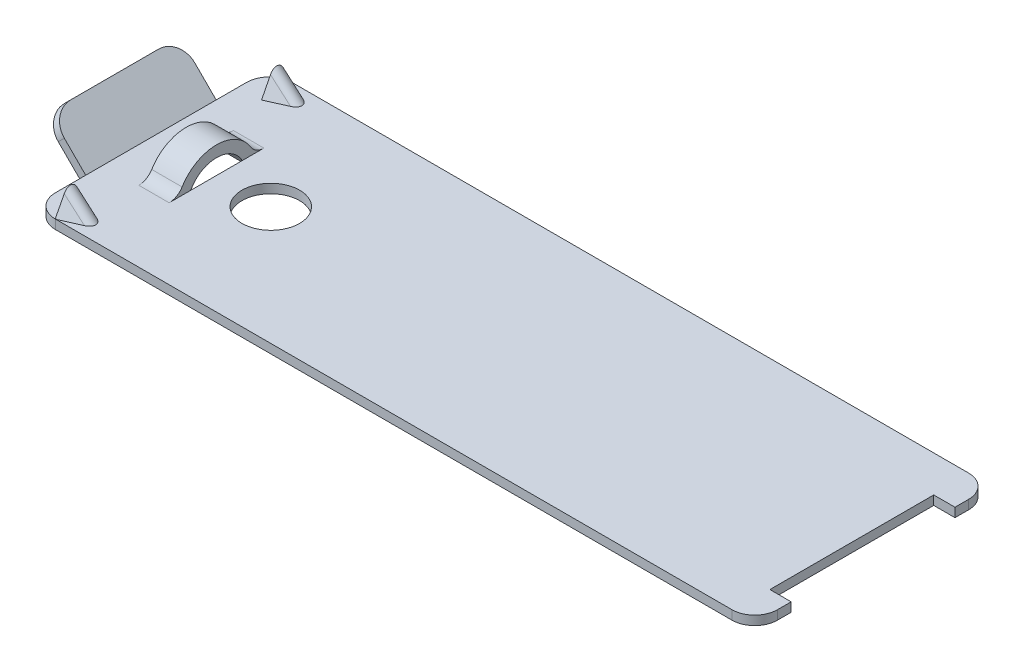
ISO-10303-21;
HEADER;
FILE_DESCRIPTION(('STEP AP214'),'2;1');
FILE_NAME('part.step','',(''),(''),'','','');
FILE_SCHEMA(('AUTOMOTIVE_DESIGN { 1 0 10303 214 1 1 1 1 }'));
ENDSEC;
DATA;
#1=APPLICATION_CONTEXT('core data for automotive mechanical design processes');
#2=APPLICATION_PROTOCOL_DEFINITION('international standard','automotive_design',2000,#1);
#3=PRODUCT_CONTEXT('',#1,'mechanical');
#4=PRODUCT('Part','Part','',(#3));
#5=PRODUCT_RELATED_PRODUCT_CATEGORY('part','',(#4));
#6=PRODUCT_DEFINITION_FORMATION('','',#4);
#7=PRODUCT_DEFINITION_CONTEXT('part definition',#1,'design');
#8=PRODUCT_DEFINITION('design','',#6,#7);
#9=PRODUCT_DEFINITION_SHAPE('','',#8);
#10=(LENGTH_UNIT() NAMED_UNIT(*) SI_UNIT(.MILLI.,.METRE.));
#11=(NAMED_UNIT(*) PLANE_ANGLE_UNIT() SI_UNIT($,.RADIAN.));
#12=(NAMED_UNIT(*) SI_UNIT($,.STERADIAN.) SOLID_ANGLE_UNIT());
#13=UNCERTAINTY_MEASURE_WITH_UNIT(LENGTH_MEASURE(1.E-05),#10,'distance_accuracy_value','');
#14=(GEOMETRIC_REPRESENTATION_CONTEXT(3) GLOBAL_UNCERTAINTY_ASSIGNED_CONTEXT((#13)) GLOBAL_UNIT_ASSIGNED_CONTEXT((#10,
#11,#12)) REPRESENTATION_CONTEXT('',''));
#15=CARTESIAN_POINT('',(0.,0.,0.));
#16=DIRECTION('',(0.,0.,1.));
#17=DIRECTION('',(1.,0.,0.));
#18=AXIS2_PLACEMENT_3D('',#15,#16,#17);
#19=CARTESIAN_POINT('',(-35.9436155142,0.1016,-8.6284868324));
#20=DIRECTION('',(0.382283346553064,0.342020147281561,-0.85841811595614));
#21=DIRECTION('',(-0.913509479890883,0.,-0.406817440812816));
#22=AXIS2_PLACEMENT_3D('',#19,#20,#21);
#23=PLANE('',#22);
#24=DIRECTION('',(0.913509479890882,0.,0.406817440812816));
#25=VECTOR('',#24,1.);
#26=CARTESIAN_POINT('',(-36.7746718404,0.1016,-8.9985850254));
#27=LINE('',#26,#25);
#28=CARTESIAN_POINT('',(-37.6057281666,0.1016,-9.3686832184));
#29=VERTEX_POINT('',#28);
#30=CARTESIAN_POINT('',(-35.9436155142,0.1016,-8.6284868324));
#31=VERTEX_POINT('',#30);
#32=EDGE_CURVE('E568',#29,#31,#27,.T.);
#33=ORIENTED_EDGE('',*,*,#32,.T.);
#34=CARTESIAN_POINT('',(-35.9436155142,0.1016,-8.6284868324));
#35=DIRECTION('',(-0.666770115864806,0.745263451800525,4.97893449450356E-09));
#36=VECTOR('',#35,1.);
#37=LINE('',#34,#36);
#38=CARTESIAN_POINT('',(-37.4207273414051,1.7526,-8.62848682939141));
#39=VERTEX_POINT('',#38);
#40=EDGE_CURVE('E701',#31,#39,#37,.T.);
#41=ORIENTED_EDGE('',*,*,#40,.T.);
#42=CARTESIAN_POINT('',(-37.6057281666,1.7526,-8.71087411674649));
#43=DIRECTION('',(0.913509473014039,0.,0.406817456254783));
#44=VECTOR('',#43,1.);
#45=LINE('',#42,#44);
#46=CARTESIAN_POINT('',(-37.6057281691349,1.75260000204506,-8.71087412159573));
#47=VERTEX_POINT('',#46);
#48=EDGE_CURVE('E735',#47,#39,#45,.T.);
#49=ORIENTED_EDGE('',*,*,#48,.F.);
#50=CARTESIAN_POINT('',(-37.6057281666,0.761999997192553,-9.10555957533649));
#51=DIRECTION('',(0.,0.928978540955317,0.370133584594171));
#52=VECTOR('',#51,1.);
#53=LINE('',#50,#52);
#54=CARTESIAN_POINT('',(-37.6057281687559,0.762,-9.10555958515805));
#55=VERTEX_POINT('',#54);
#56=EDGE_CURVE('E664',#55,#47,#53,.T.);
#57=ORIENTED_EDGE('',*,*,#56,.F.);
#58=CARTESIAN_POINT('',(-37.6057281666,0.1016,-9.3686832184));
#59=DIRECTION('',(0.,0.928978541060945,0.370133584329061));
#60=VECTOR('',#59,1.);
#61=LINE('',#58,#60);
#62=EDGE_CURVE('E870',#29,#55,#61,.T.);
#63=ORIENTED_EDGE('',*,*,#62,.F.);
#64=EDGE_LOOP('',(#33,#41,#49,#57,#63));
#65=FACE_BOUND('',#64,.T.);
#66=ADVANCED_FACE('F37',(#65),#23,.F.);
#67=CARTESIAN_POINT('',(-37.6057281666,0.1016,-7.8882904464));
#68=DIRECTION('',(0.382283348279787,0.342020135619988,0.858418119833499));
#69=DIRECTION('',(0.913509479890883,0.,-0.406817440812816));
#70=AXIS2_PLACEMENT_3D('',#67,#68,#69);
#71=PLANE('',#70);
#72=CARTESIAN_POINT('',(-37.4207273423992,1.7526,-8.6284868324));
#73=DIRECTION('',(-0.913509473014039,0.,0.406817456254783));
#74=VECTOR('',#73,1.);
#75=LINE('',#72,#74);
#76=CARTESIAN_POINT('',(-37.6057281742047,1.7526,-8.54609953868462));
#77=VERTEX_POINT('',#76);
#78=EDGE_CURVE('E762',#39,#77,#75,.T.);
#79=ORIENTED_EDGE('',*,*,#78,.F.);
#80=ORIENTED_EDGE('',*,*,#40,.F.);
#81=DIRECTION('',(-0.913509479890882,0.,0.406817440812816));
#82=VECTOR('',#81,1.);
#83=CARTESIAN_POINT('',(-36.7746718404,0.1016,-8.2583886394));
#84=LINE('',#83,#82);
#85=CARTESIAN_POINT('',(-37.6057281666,0.1016,-7.8882904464));
#86=VERTEX_POINT('',#85);
#87=EDGE_CURVE('E562',#31,#86,#84,.T.);
#88=ORIENTED_EDGE('',*,*,#87,.T.);
#89=CARTESIAN_POINT('',(-37.6057281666,0.762000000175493,-8.15141408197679));
#90=DIRECTION('',(0.,-0.928978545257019,0.370133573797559));
#91=VECTOR('',#90,1.);
#92=LINE('',#89,#91);
#93=CARTESIAN_POINT('',(-37.605728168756,0.762,-8.15141408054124));
#94=VERTEX_POINT('',#93);
#95=EDGE_CURVE('E248',#94,#86,#92,.T.);
#96=ORIENTED_EDGE('',*,*,#95,.F.);
#97=CARTESIAN_POINT('',(-37.6057281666,1.75260000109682,-8.54609953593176));
#98=DIRECTION('',(0.,-0.928978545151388,0.370133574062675));
#99=VECTOR('',#98,1.);
#100=LINE('',#97,#99);
#101=EDGE_CURVE('E722',#77,#94,#100,.T.);
#102=ORIENTED_EDGE('',*,*,#101,.F.);
#103=EDGE_LOOP('',(#79,#80,#88,#96,#102));
#104=FACE_BOUND('',#103,.T.);
#105=ADVANCED_FACE('F677',(#104),#71,.F.);
#106=CARTESIAN_POINT('',(-37.6057281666,1.7526,-8.5451109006));
#107=DIRECTION('',(0.,-1.,0.));
#108=DIRECTION('',(0.,0.,-1.));
#109=AXIS2_PLACEMENT_3D('',#106,#107,#108);
#110=PLANE('',#109);
#111=ORIENTED_EDGE('',*,*,#48,.T.);
#112=ORIENTED_EDGE('',*,*,#78,.T.);
#113=DIRECTION('',(0.,0.,-1.));
#114=VECTOR('',#113,1.);
#115=CARTESIAN_POINT('',(-37.6057281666,1.75260000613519,-8.6284868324));
#116=LINE('',#115,#114);
#117=EDGE_CURVE('E499',#77,#47,#116,.T.);
#118=ORIENTED_EDGE('',*,*,#117,.T.);
#119=EDGE_LOOP('',(#111,#112,#118));
#120=FACE_BOUND('',#119,.T.);
#121=ADVANCED_FACE('F739',(#120),#110,.T.);
#122=CARTESIAN_POINT('',(-43.0667281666,3.302,-5.461));
#123=DIRECTION('',(-0.707106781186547,-0.707106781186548,0.));
#124=DIRECTION('',(0.707106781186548,-0.707106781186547,0.));
#125=AXIS2_PLACEMENT_3D('',#122,#123,#124);
#126=PLANE('',#125);
#127=DIRECTION('',(0.707106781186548,-0.707106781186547,0.));
#128=VECTOR('',#127,1.);
#129=CARTESIAN_POINT('',(-43.0667281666,3.302,5.461));
#130=LINE('',#129,#128);
#131=CARTESIAN_POINT('',(-39.7647281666,0.,5.461));
#132=VERTEX_POINT('',#131);
#133=CARTESIAN_POINT('',(-41.8094923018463,2.04476413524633,5.46099998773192));
#134=VERTEX_POINT('',#133);
#135=EDGE_CURVE('E528',#132,#134,#130,.F.);
#136=ORIENTED_EDGE('',*,*,#135,.T.);
#137=CARTESIAN_POINT('',(-41.8094923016,2.044764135,3.683));
#138=DIRECTION('',(-0.707106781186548,-0.707106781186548,0.));
#139=DIRECTION('',(0.707106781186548,-0.707106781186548,0.));
#140=AXIS2_PLACEMENT_3D('',#137,#138,#139);
#141=CIRCLE('',#140,1.77799997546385);
#142=CARTESIAN_POINT('',(-43.0667281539,3.3019999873,3.68299999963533));
#143=VERTEX_POINT('',#142);
#144=EDGE_CURVE('E529',#134,#143,#141,.T.);
#145=ORIENTED_EDGE('',*,*,#144,.T.);
#146=DIRECTION('',(0.,0.,1.));
#147=VECTOR('',#146,1.);
#148=CARTESIAN_POINT('',(-43.0667281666,3.302,0.));
#149=LINE('',#148,#147);
#150=CARTESIAN_POINT('',(-43.0667281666,3.302,-3.683));
#151=VERTEX_POINT('',#150);
#152=EDGE_CURVE('E534',#151,#143,#149,.T.);
#153=ORIENTED_EDGE('',*,*,#152,.F.);
#154=CARTESIAN_POINT('',(-41.8094923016,2.044764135,-3.683));
#155=DIRECTION('',(0.707106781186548,0.707106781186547,0.));
#156=DIRECTION('',(-0.707106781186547,0.707106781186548,0.));
#157=AXIS2_PLACEMENT_3D('',#154,#155,#156);
#158=CIRCLE('',#157,1.77800001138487);
#159=CARTESIAN_POINT('',(-41.8094923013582,2.04476413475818,-5.46100000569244));
#160=VERTEX_POINT('',#159);
#161=EDGE_CURVE('E540',#151,#160,#158,.F.);
#162=ORIENTED_EDGE('',*,*,#161,.T.);
#163=DIRECTION('',(0.707106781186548,-0.707106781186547,0.));
#164=VECTOR('',#163,1.);
#165=CARTESIAN_POINT('',(-43.0667281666,3.302,-5.461));
#166=LINE('',#165,#164);
#167=CARTESIAN_POINT('',(-39.7647281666,0.,-5.461));
#168=VERTEX_POINT('',#167);
#169=EDGE_CURVE('E552',#160,#168,#166,.T.);
#170=ORIENTED_EDGE('',*,*,#169,.T.);
#171=DIRECTION('',(0.,0.,-1.));
#172=VECTOR('',#171,1.);
#173=CARTESIAN_POINT('',(-39.7647281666,0.,9.906));
#174=LINE('',#173,#172);
#175=EDGE_CURVE('E1014',#132,#168,#174,.T.);
#176=ORIENTED_EDGE('',*,*,#175,.F.);
#177=EDGE_LOOP('',(#136,#145,#153,#162,#170,#176));
#178=FACE_BOUND('',#177,.T.);
#179=ADVANCED_FACE('F748',(#178),#126,.T.);
#180=CARTESIAN_POINT('',(-36.561711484,1.27,-3.3229742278));
#181=DIRECTION('',(1.,0.,0.));
#182=DIRECTION('',(0.,0.,-1.));
#183=AXIS2_PLACEMENT_3D('',#180,#181,#182);
#184=CYLINDRICAL_SURFACE('',#183,1.27);
#185=DIRECTION('',(1.,0.,0.));
#186=VECTOR('',#185,1.);
#187=CARTESIAN_POINT('',(-39.7647281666,0.,-3.32297422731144));
#188=LINE('',#187,#186);
#189=CARTESIAN_POINT('',(-34.0217114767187,0.,-3.32297422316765));
#190=VERTEX_POINT('',#189);
#191=CARTESIAN_POINT('',(-36.5617114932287,0.,-3.32297422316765));
#192=VERTEX_POINT('',#191);
#193=EDGE_CURVE('E1005',#190,#192,#188,.F.);
#194=ORIENTED_EDGE('',*,*,#193,.F.);
#195=CARTESIAN_POINT('',(-34.021711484,0.761999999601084,-2.15900000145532));
#196=CARTESIAN_POINT('',(-34.021711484,0.591965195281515,-2.23338466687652));
#197=CARTESIAN_POINT('',(-34.021711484,0.450545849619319,-2.35271916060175));
#198=CARTESIAN_POINT('',(-34.021711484,0.309322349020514,-2.47188839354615));
#199=CARTESIAN_POINT('',(-34.021711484,0.207441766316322,-2.62736657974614));
#200=CARTESIAN_POINT('',(-34.021711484,0.106164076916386,-2.78192470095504));
#201=CARTESIAN_POINT('',(-34.021711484,0.0529648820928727,-2.96003412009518));
#202=CARTESIAN_POINT('',(-34.021711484,0.00016123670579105,-3.13681925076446));
#203=CARTESIAN_POINT('',(-34.021711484,0.,-3.32297422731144));
#204=B_SPLINE_CURVE_WITH_KNOTS('',2,(#195,#196,#197,#198,#199,#200,#201,#202,#203),
.UNSPECIFIED.,.F.,.F.,(3,2,2,2,3),(0.,0.25,0.5,0.75,1.),.UNSPECIFIED.);
#205=CARTESIAN_POINT('',(-34.0217114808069,0.762000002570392,-2.15900000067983));
#206=VERTEX_POINT('',#205);
#207=EDGE_CURVE('E646',#206,#190,#204,.T.);
#208=ORIENTED_EDGE('',*,*,#207,.F.);
#209=DIRECTION('',(-1.,0.,0.));
#210=VECTOR('',#209,1.);
#211=CARTESIAN_POINT('',(-35.291711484,0.76200000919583,-2.15900000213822));
#212=LINE('',#211,#210);
#213=CARTESIAN_POINT('',(-36.5617114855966,0.762000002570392,-2.15900000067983));
#214=VERTEX_POINT('',#213);
#215=EDGE_CURVE('E516',#214,#206,#212,.F.);
#216=ORIENTED_EDGE('',*,*,#215,.F.);
#217=CARTESIAN_POINT('',(-36.561711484,0.,-3.32297422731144));
#218=CARTESIAN_POINT('',(-36.561711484,0.000160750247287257,-3.13738088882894));
#219=CARTESIAN_POINT('',(-36.561711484,0.0529648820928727,-2.96003412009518));
#220=CARTESIAN_POINT('',(-36.561711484,0.10569588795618,-2.78293295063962));
#221=CARTESIAN_POINT('',(-36.561711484,0.207441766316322,-2.62736657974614));
#222=CARTESIAN_POINT('',(-36.561711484,0.308585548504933,-2.47272079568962));
#223=CARTESIAN_POINT('',(-36.561711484,0.450545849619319,-2.35271916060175));
#224=CARTESIAN_POINT('',(-36.561711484,0.59145064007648,-2.23360976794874));
#225=CARTESIAN_POINT('',(-36.561711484,0.761999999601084,-2.15900000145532));
#226=B_SPLINE_CURVE_WITH_KNOTS('',2,(#217,#218,#219,#220,#221,#222,#223,#224,#225),
.UNSPECIFIED.,.F.,.F.,(3,2,2,2,3),(0.,0.25,0.5,0.75,1.),.UNSPECIFIED.);
#227=EDGE_CURVE('E633',#192,#214,#226,.T.);
#228=ORIENTED_EDGE('',*,*,#227,.F.);
#229=EDGE_LOOP('',(#194,#208,#216,#228));
#230=FACE_BOUND('',#229,.T.);
#231=ADVANCED_FACE('F613',(#230),#184,.T.);
#232=CARTESIAN_POINT('',(-36.561711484,1.27,3.3229742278));
#233=DIRECTION('',(1.,0.,0.));
#234=DIRECTION('',(0.,0.,-1.));
#235=AXIS2_PLACEMENT_3D('',#232,#233,#234);
#236=CYLINDRICAL_SURFACE('',#235,1.27);
#237=DIRECTION('',(1.,0.,0.));
#238=VECTOR('',#237,1.);
#239=CARTESIAN_POINT('',(-39.7647281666,0.,3.32297422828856));
#240=LINE('',#239,#238);
#241=CARTESIAN_POINT('',(-36.5617114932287,0.,3.32297422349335));
#242=VERTEX_POINT('',#241);
#243=CARTESIAN_POINT('',(-34.0217114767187,0.,3.32297422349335));
#244=VERTEX_POINT('',#243);
#245=EDGE_CURVE('E1003',#242,#244,#240,.T.);
#246=ORIENTED_EDGE('',*,*,#245,.F.);
#247=CARTESIAN_POINT('',(-36.561711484,0.761999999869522,2.15900000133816));
#248=CARTESIAN_POINT('',(-36.561711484,0.591965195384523,2.23338466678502));
#249=CARTESIAN_POINT('',(-36.561711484,0.450545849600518,2.35271916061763));
#250=CARTESIAN_POINT('',(-36.561711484,0.30932234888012,2.47188839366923));
#251=CARTESIAN_POINT('',(-36.561711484,0.20744176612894,2.62736658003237));
#252=CARTESIAN_POINT('',(-36.561711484,0.106164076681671,2.78192470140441));
#253=CARTESIAN_POINT('',(-36.561711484,0.0529648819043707,2.96003412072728));
#254=CARTESIAN_POINT('',(-36.561711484,0.000161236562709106,3.13681925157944));
#255=CARTESIAN_POINT('',(-36.561711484,0.,3.32297422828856));
#256=B_SPLINE_CURVE_WITH_KNOTS('',2,(#247,#248,#249,#250,#251,#252,#253,#254,#255),
.UNSPECIFIED.,.F.,.F.,(3,2,2,2,3),(0.,0.25,0.5,0.75,1.),.UNSPECIFIED.);
#257=CARTESIAN_POINT('',(-36.5617114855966,0.762000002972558,2.15900000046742));
#258=VERTEX_POINT('',#257);
#259=EDGE_CURVE('E1177',#258,#242,#256,.T.);
#260=ORIENTED_EDGE('',*,*,#259,.F.);
#261=DIRECTION('',(1.,0.,0.));
#262=VECTOR('',#261,1.);
#263=CARTESIAN_POINT('',(-35.291711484,0.762000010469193,2.15900000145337));
#264=LINE('',#263,#262);
#265=CARTESIAN_POINT('',(-34.0217114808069,0.762000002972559,2.15900000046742));
#266=VERTEX_POINT('',#265);
#267=EDGE_CURVE('E500',#266,#258,#264,.F.);
#268=ORIENTED_EDGE('',*,*,#267,.F.);
#269=CARTESIAN_POINT('',(-34.021711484,0.,3.32297422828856));
#270=CARTESIAN_POINT('',(-34.021711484,0.000160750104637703,3.13738088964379));
#271=CARTESIAN_POINT('',(-34.021711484,0.0529648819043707,2.96003412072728));
#272=CARTESIAN_POINT('',(-34.021711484,0.105695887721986,2.78293295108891));
#273=CARTESIAN_POINT('',(-34.021711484,0.20744176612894,2.62736658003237));
#274=CARTESIAN_POINT('',(-34.021711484,0.308585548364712,2.47272079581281));
#275=CARTESIAN_POINT('',(-34.021711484,0.450545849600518,2.35271916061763));
#276=CARTESIAN_POINT('',(-34.021711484,0.591450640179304,2.23360976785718));
#277=CARTESIAN_POINT('',(-34.021711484,0.761999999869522,2.15900000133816));
#278=B_SPLINE_CURVE_WITH_KNOTS('',2,(#269,#270,#271,#272,#273,#274,#275,#276,#277),
.UNSPECIFIED.,.F.,.F.,(3,2,2,2,3),(0.,0.25,0.5,0.75,1.),.UNSPECIFIED.);
#279=EDGE_CURVE('E573',#244,#266,#278,.T.);
#280=ORIENTED_EDGE('',*,*,#279,.F.);
#281=EDGE_LOOP('',(#246,#260,#268,#280));
#282=FACE_BOUND('',#281,.T.);
#283=ADVANCED_FACE('F602',(#282),#236,.T.);
#284=CARTESIAN_POINT('',(-35.9436155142,0.,-8.6284868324));
#285=DIRECTION('',(0.406817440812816,0.,-0.913509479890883));
#286=DIRECTION('',(-0.913509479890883,0.,-0.406817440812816));
#287=AXIS2_PLACEMENT_3D('',#284,#285,#286);
#288=PLANE('',#287);
#289=ORIENTED_EDGE('',*,*,#32,.F.);
#290=DIRECTION('',(0.,1.,0.));
#291=VECTOR('',#290,1.);
#292=CARTESIAN_POINT('',(-37.6057281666,0.0508,-9.3686832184));
#293=LINE('',#292,#291);
#294=CARTESIAN_POINT('',(-37.6057281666,0.,-9.3686832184));
#295=VERTEX_POINT('',#294);
#296=EDGE_CURVE('E571',#295,#29,#293,.T.);
#297=ORIENTED_EDGE('',*,*,#296,.F.);
#298=DIRECTION('',(-0.913509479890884,0.,-0.406817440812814));
#299=VECTOR('',#298,1.);
#300=CARTESIAN_POINT('',(-35.9436155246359,0.,-8.62848683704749));
#301=LINE('',#300,#299);
#302=CARTESIAN_POINT('',(-35.9436155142,0.,-8.6284868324));
#303=VERTEX_POINT('',#302);
#304=EDGE_CURVE('E1000',#303,#295,#301,.T.);
#305=ORIENTED_EDGE('',*,*,#304,.F.);
#306=DIRECTION('',(0.,1.,0.));
#307=VECTOR('',#306,1.);
#308=CARTESIAN_POINT('',(-35.9436155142,0.0508,-8.6284868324));
#309=LINE('',#308,#307);
#310=EDGE_CURVE('E565',#303,#31,#309,.T.);
#311=ORIENTED_EDGE('',*,*,#310,.T.);
#312=EDGE_LOOP('',(#289,#297,#305,#311));
#313=FACE_BOUND('',#312,.T.);
#314=ADVANCED_FACE('F612',(#313),#288,.F.);
#315=CARTESIAN_POINT('',(-37.6057281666,0.,-7.8882904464));
#316=DIRECTION('',(0.406817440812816,0.,0.913509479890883));
#317=DIRECTION('',(0.913509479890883,0.,-0.406817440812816));
#318=AXIS2_PLACEMENT_3D('',#315,#316,#317);
#319=PLANE('',#318);
#320=ORIENTED_EDGE('',*,*,#87,.F.);
#321=ORIENTED_EDGE('',*,*,#310,.F.);
#322=DIRECTION('',(0.913509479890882,0.,-0.406817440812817));
#323=VECTOR('',#322,1.);
#324=CARTESIAN_POINT('',(-37.6057281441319,0.,-7.88829045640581));
#325=LINE('',#324,#323);
#326=CARTESIAN_POINT('',(-37.6057281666,0.,-7.8882904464));
#327=VERTEX_POINT('',#326);
#328=EDGE_CURVE('E997',#327,#303,#325,.T.);
#329=ORIENTED_EDGE('',*,*,#328,.F.);
#330=DIRECTION('',(0.,-1.,0.));
#331=VECTOR('',#330,1.);
#332=CARTESIAN_POINT('',(-37.6057281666,0.0508,-7.8882904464));
#333=LINE('',#332,#331);
#334=EDGE_CURVE('E560',#86,#327,#333,.T.);
#335=ORIENTED_EDGE('',*,*,#334,.F.);
#336=EDGE_LOOP('',(#320,#321,#329,#335));
#337=FACE_BOUND('',#336,.T.);
#338=ADVANCED_FACE('F1167',(#337),#319,.F.);
#339=CARTESIAN_POINT('',(-37.6173205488,0.,9.3790810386));
#340=DIRECTION('',(0.406817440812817,0.,0.913509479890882));
#341=DIRECTION('',(0.913509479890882,0.,-0.406817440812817));
#342=AXIS2_PLACEMENT_3D('',#339,#340,#341);
#343=PLANE('',#342);
#344=DIRECTION('',(0.913509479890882,0.,-0.406817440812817));
#345=VECTOR('',#344,1.);
#346=CARTESIAN_POINT('',(-36.7862642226,0.1016,9.0089828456));
#347=LINE('',#346,#345);
#348=CARTESIAN_POINT('',(-37.6173205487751,0.101599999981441,9.37908103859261));
#349=VERTEX_POINT('',#348);
#350=CARTESIAN_POINT('',(-35.9552078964,0.1016,8.6388846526));
#351=VERTEX_POINT('',#350);
#352=EDGE_CURVE('E553',#349,#351,#347,.T.);
#353=ORIENTED_EDGE('',*,*,#352,.T.);
#354=DIRECTION('',(0.,-1.,0.));
#355=VECTOR('',#354,1.);
#356=CARTESIAN_POINT('',(-35.9552078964,0.0508,8.6388846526));
#357=LINE('',#356,#355);
#358=CARTESIAN_POINT('',(-35.9552078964,0.,8.6388846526));
#359=VERTEX_POINT('',#358);
#360=EDGE_CURVE('E550',#351,#359,#357,.T.);
#361=ORIENTED_EDGE('',*,*,#360,.T.);
#362=DIRECTION('',(0.913509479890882,0.,-0.406817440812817));
#363=VECTOR('',#362,1.);
#364=CARTESIAN_POINT('',(-37.6173205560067,0.,9.37908104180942));
#365=LINE('',#364,#363);
#366=CARTESIAN_POINT('',(-37.6173205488,0.,9.3790810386));
#367=VERTEX_POINT('',#366);
#368=EDGE_CURVE('E994',#367,#359,#365,.T.);
#369=ORIENTED_EDGE('',*,*,#368,.F.);
#370=DIRECTION('',(0.,-1.,0.));
#371=VECTOR('',#370,1.);
#372=CARTESIAN_POINT('',(-37.6173205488,0.0508,9.3790810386));
#373=LINE('',#372,#371);
#374=EDGE_CURVE('E558',#349,#367,#373,.T.);
#375=ORIENTED_EDGE('',*,*,#374,.F.);
#376=EDGE_LOOP('',(#353,#361,#369,#375));
#377=FACE_BOUND('',#376,.T.);
#378=ADVANCED_FACE('F1163',(#377),#343,.F.);
#379=CARTESIAN_POINT('',(-37.6173205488,0.1016,9.3790810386));
#380=DIRECTION('',(0.382283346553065,0.34202014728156,0.85841811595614));
#381=DIRECTION('',(0.913509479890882,0.,-0.406817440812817));
#382=AXIS2_PLACEMENT_3D('',#379,#380,#381);
#383=PLANE('',#382);
#384=DIRECTION('',(-0.913509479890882,0.,0.406817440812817));
#385=VECTOR('',#384,1.);
#386=CARTESIAN_POINT('',(-37.0307268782,1.7526,8.4600414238));
#387=LINE('',#386,#385);
#388=CARTESIAN_POINT('',(-37.4323197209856,1.7526,8.63888463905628));
#389=VERTEX_POINT('',#388);
#390=CARTESIAN_POINT('',(-37.6057281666,1.75260000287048,8.71610943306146));
#391=VERTEX_POINT('',#390);
#392=EDGE_CURVE('E234',#389,#391,#387,.T.);
#393=ORIENTED_EDGE('',*,*,#392,.F.);
#394=DIRECTION('',(0.666770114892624,-0.745263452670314,5.75842948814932E-09));
#395=VECTOR('',#394,1.);
#396=CARTESIAN_POINT('',(-37.4323197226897,1.75259999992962,8.63888463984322));
#397=LINE('',#396,#395);
#398=EDGE_CURVE('E549',#389,#351,#397,.T.);
#399=ORIENTED_EDGE('',*,*,#398,.T.);
#400=ORIENTED_EDGE('',*,*,#352,.F.);
#401=DIRECTION('',(-9.55189715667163E-10,0.928978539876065,-0.370133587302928));
#402=VECTOR('',#401,1.);
#403=CARTESIAN_POINT('',(-37.6173205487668,0.101599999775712,9.37908103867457));
#404=LINE('',#403,#402);
#405=CARTESIAN_POINT('',(-37.6173205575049,0.762000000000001,9.11595739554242));
#406=VERTEX_POINT('',#405);
#407=EDGE_CURVE('E545',#349,#406,#404,.T.);
#408=ORIENTED_EDGE('',*,*,#407,.T.);
#409=DIRECTION('',(-0.913509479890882,0.,0.406817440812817));
#410=VECTOR('',#409,1.);
#411=CARTESIAN_POINT('',(-36.88404928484,0.762,8.78940627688));
#412=LINE('',#411,#410);
#413=CARTESIAN_POINT('',(-37.6057281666,0.762,9.11079490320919));
#414=VERTEX_POINT('',#413);
#415=EDGE_CURVE('E555',#414,#406,#412,.T.);
#416=ORIENTED_EDGE('',*,*,#415,.F.);
#417=DIRECTION('',(0.,-0.928978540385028,0.370133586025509));
#418=VECTOR('',#417,1.);
#419=CARTESIAN_POINT('',(-37.6057281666,1.7526,8.71610943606));
#420=LINE('',#419,#418);
#421=EDGE_CURVE('E41',#391,#414,#420,.T.);
#422=ORIENTED_EDGE('',*,*,#421,.F.);
#423=EDGE_LOOP('',(#393,#399,#400,#408,#416,#422));
#424=FACE_BOUND('',#423,.T.);
#425=ADVANCED_FACE('F1159',(#424),#383,.F.);
#426=CARTESIAN_POINT('',(-35.9552078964,0.,8.6388846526));
#427=DIRECTION('',(0.406817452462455,0.,-0.913509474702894));
#428=DIRECTION('',(-0.913509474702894,0.,-0.406817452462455));
#429=AXIS2_PLACEMENT_3D('',#426,#427,#428);
#430=PLANE('',#429);
#431=DIRECTION('',(-0.913509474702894,0.,-0.406817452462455));
#432=VECTOR('',#431,1.);
#433=CARTESIAN_POINT('',(-36.7862642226,0.1016,8.2687864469));
#434=LINE('',#433,#432);
#435=CARTESIAN_POINT('',(-37.6173205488,0.1016,7.8986882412));
#436=VERTEX_POINT('',#435);
#437=EDGE_CURVE('E546',#351,#436,#434,.T.);
#438=ORIENTED_EDGE('',*,*,#437,.T.);
#439=DIRECTION('',(0.,-1.,0.));
#440=VECTOR('',#439,1.);
#441=CARTESIAN_POINT('',(-37.6173205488,0.381,7.8986882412));
#442=LINE('',#441,#440);
#443=CARTESIAN_POINT('',(-37.6173205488,0.,7.8986882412));
#444=VERTEX_POINT('',#443);
#445=EDGE_CURVE('E541',#436,#444,#442,.T.);
#446=ORIENTED_EDGE('',*,*,#445,.T.);
#447=DIRECTION('',(-0.913509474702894,0.,-0.406817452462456));
#448=VECTOR('',#447,1.);
#449=CARTESIAN_POINT('',(-35.9552078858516,0.,8.63888465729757));
#450=LINE('',#449,#448);
#451=EDGE_CURVE('E992',#359,#444,#450,.T.);
#452=ORIENTED_EDGE('',*,*,#451,.F.);
#453=ORIENTED_EDGE('',*,*,#360,.F.);
#454=EDGE_LOOP('',(#438,#446,#452,#453));
#455=FACE_BOUND('',#454,.T.);
#456=ADVANCED_FACE('F1156',(#455),#430,.F.);
#457=CARTESIAN_POINT('',(-41.8094923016,0.,-5.461));
#458=DIRECTION('',(0.,0.,1.));
#459=DIRECTION('',(1.,0.,0.));
#460=AXIS2_PLACEMENT_3D('',#457,#458,#459);
#461=PLANE('',#460);
#462=DIRECTION('',(-0.70710678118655,-0.707106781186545,0.));
#463=VECTOR('',#462,1.);
#464=CARTESIAN_POINT('',(-41.5554923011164,2.29876413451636,-5.46100001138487));
#465=LINE('',#464,#463);
#466=CARTESIAN_POINT('',(-41.3014923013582,2.55276413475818,-5.46100000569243));
#467=VERTEX_POINT('',#466);
#468=EDGE_CURVE('E538',#160,#467,#465,.F.);
#469=ORIENTED_EDGE('',*,*,#468,.T.);
#470=DIRECTION('',(-0.707106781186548,0.707106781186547,0.));
#471=VECTOR('',#470,1.);
#472=CARTESIAN_POINT('',(-41.0347281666,2.286,-5.461));
#473=LINE('',#472,#471);
#474=CARTESIAN_POINT('',(-39.5107281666,0.762,-5.461000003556));
#475=VERTEX_POINT('',#474);
#476=EDGE_CURVE('E424',#475,#467,#473,.T.);
#477=ORIENTED_EDGE('',*,*,#476,.F.);
#478=DIRECTION('',(0.,-1.,0.));
#479=VECTOR('',#478,1.);
#480=CARTESIAN_POINT('',(-39.5107281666,0.381,-5.461));
#481=LINE('',#480,#479);
#482=CARTESIAN_POINT('',(-39.5107281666,0.,-5.461));
#483=VERTEX_POINT('',#482);
#484=EDGE_CURVE('E432',#475,#483,#481,.T.);
#485=ORIENTED_EDGE('',*,*,#484,.T.);
#486=DIRECTION('',(1.,0.,0.));
#487=VECTOR('',#486,1.);
#488=CARTESIAN_POINT('',(-39.7647281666,0.,-5.461));
#489=LINE('',#488,#487);
#490=EDGE_CURVE('E1009',#168,#483,#489,.T.);
#491=ORIENTED_EDGE('',*,*,#490,.F.);
#492=ORIENTED_EDGE('',*,*,#169,.F.);
#493=EDGE_LOOP('',(#469,#477,#485,#491,#492));
#494=FACE_BOUND('',#493,.T.);
#495=ADVANCED_FACE('F1034',(#494),#461,.F.);
#496=CARTESIAN_POINT('',(-41.8094923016,2.044764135,-3.683));
#497=DIRECTION('',(0.707106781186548,0.707106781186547,0.));
#498=DIRECTION('',(-0.707106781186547,0.707106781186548,0.));
#499=AXIS2_PLACEMENT_3D('',#496,#497,#498);
#500=CYLINDRICAL_SURFACE('',#499,1.77800001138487);
#501=ORIENTED_EDGE('',*,*,#468,.F.);
#502=ORIENTED_EDGE('',*,*,#161,.F.);
#503=DIRECTION('',(-0.707106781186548,-0.707106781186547,0.));
#504=VECTOR('',#503,1.);
#505=CARTESIAN_POINT('',(-42.8127281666,3.556,-3.683));
#506=LINE('',#505,#504);
#507=CARTESIAN_POINT('',(-42.5587281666,3.81,-3.683));
#508=VERTEX_POINT('',#507);
#509=EDGE_CURVE('E535',#508,#151,#506,.T.);
#510=ORIENTED_EDGE('',*,*,#509,.F.);
#511=CARTESIAN_POINT('',(-41.3014923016,2.552764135,-3.683));
#512=DIRECTION('',(0.707106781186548,0.707106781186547,0.));
#513=DIRECTION('',(-0.707106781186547,0.707106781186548,0.));
#514=AXIS2_PLACEMENT_3D('',#511,#512,#513);
#515=CIRCLE('',#514,1.77800001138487);
#516=EDGE_CURVE('E423',#467,#508,#515,.T.);
#517=ORIENTED_EDGE('',*,*,#516,.F.);
#518=EDGE_LOOP('',(#501,#502,#510,#517));
#519=FACE_BOUND('',#518,.T.);
#520=ADVANCED_FACE('F614',(#519),#500,.T.);
#521=CARTESIAN_POINT('',(-42.5587281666,3.81,-3.683));
#522=DIRECTION('',(-0.707106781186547,0.707106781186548,0.));
#523=DIRECTION('',(-0.707106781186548,-0.707106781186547,0.));
#524=AXIS2_PLACEMENT_3D('',#521,#522,#523);
#525=PLANE('',#524);
#526=ORIENTED_EDGE('',*,*,#152,.T.);
#527=DIRECTION('',(-0.707106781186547,-0.707106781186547,0.));
#528=VECTOR('',#527,1.);
#529=CARTESIAN_POINT('',(-42.8127281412,3.55599997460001,3.68299999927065));
#530=LINE('',#529,#528);
#531=CARTESIAN_POINT('',(-42.5587281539,3.80999998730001,3.68299999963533));
#532=VERTEX_POINT('',#531);
#533=EDGE_CURVE('E532',#143,#532,#530,.F.);
#534=ORIENTED_EDGE('',*,*,#533,.T.);
#535=DIRECTION('',(0.,0.,1.));
#536=VECTOR('',#535,1.);
#537=CARTESIAN_POINT('',(-42.5587281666,3.81,0.));
#538=LINE('',#537,#536);
#539=EDGE_CURVE('E420',#508,#532,#538,.T.);
#540=ORIENTED_EDGE('',*,*,#539,.F.);
#541=ORIENTED_EDGE('',*,*,#509,.T.);
#542=EDGE_LOOP('',(#526,#534,#540,#541));
#543=FACE_BOUND('',#542,.T.);
#544=ADVANCED_FACE('F1052',(#543),#525,.T.);
#545=CARTESIAN_POINT('',(-41.3014923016,2.552764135,3.683));
#546=DIRECTION('',(-0.707106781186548,-0.707106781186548,0.));
#547=DIRECTION('',(0.707106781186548,-0.707106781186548,0.));
#548=AXIS2_PLACEMENT_3D('',#545,#546,#547);
#549=CYLINDRICAL_SURFACE('',#548,1.77799997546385);
#550=DIRECTION('',(-0.707106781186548,-0.707106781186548,0.));
#551=VECTOR('',#550,1.);
#552=CARTESIAN_POINT('',(-41.3014923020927,2.55276413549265,5.46099997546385));
#553=LINE('',#552,#551);
#554=CARTESIAN_POINT('',(-41.3014923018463,2.55276413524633,5.46099998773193));
#555=VERTEX_POINT('',#554);
#556=EDGE_CURVE('E519',#134,#555,#553,.F.);
#557=ORIENTED_EDGE('',*,*,#556,.T.);
#558=CARTESIAN_POINT('',(-41.3014923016,2.552764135,3.683));
#559=DIRECTION('',(-0.707106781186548,-0.707106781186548,0.));
#560=DIRECTION('',(0.707106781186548,-0.707106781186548,0.));
#561=AXIS2_PLACEMENT_3D('',#558,#559,#560);
#562=CIRCLE('',#561,1.77799997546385);
#563=EDGE_CURVE('E417',#532,#555,#562,.F.);
#564=ORIENTED_EDGE('',*,*,#563,.F.);
#565=ORIENTED_EDGE('',*,*,#533,.F.);
#566=ORIENTED_EDGE('',*,*,#144,.F.);
#567=EDGE_LOOP('',(#557,#564,#565,#566));
#568=FACE_BOUND('',#567,.T.);
#569=ADVANCED_FACE('F1048',(#568),#549,.T.);
#570=CARTESIAN_POINT('',(-39.5107281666,0.,5.461));
#571=DIRECTION('',(0.,0.,-1.));
#572=DIRECTION('',(-1.,0.,0.));
#573=AXIS2_PLACEMENT_3D('',#570,#571,#572);
#574=PLANE('',#573);
#575=ORIENTED_EDGE('',*,*,#556,.F.);
#576=ORIENTED_EDGE('',*,*,#135,.F.);
#577=DIRECTION('',(1.,0.,0.));
#578=VECTOR('',#577,1.);
#579=CARTESIAN_POINT('',(-39.7647281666,0.,5.461));
#580=LINE('',#579,#578);
#581=CARTESIAN_POINT('',(-39.5107281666,0.,5.461));
#582=VERTEX_POINT('',#581);
#583=EDGE_CURVE('E1017',#582,#132,#580,.F.);
#584=ORIENTED_EDGE('',*,*,#583,.F.);
#585=DIRECTION('',(0.,-1.,0.));
#586=VECTOR('',#585,1.);
#587=CARTESIAN_POINT('',(-39.5107281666,1.2763820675,5.461));
#588=LINE('',#587,#586);
#589=CARTESIAN_POINT('',(-39.5107281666,0.761999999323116,5.461000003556));
#590=VERTEX_POINT('',#589);
#591=EDGE_CURVE('E526',#590,#582,#588,.T.);
#592=ORIENTED_EDGE('',*,*,#591,.F.);
#593=DIRECTION('',(0.707106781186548,-0.707106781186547,0.));
#594=VECTOR('',#593,1.);
#595=CARTESIAN_POINT('',(-41.0347281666,2.286,5.461));
#596=LINE('',#595,#594);
#597=EDGE_CURVE('E413',#555,#590,#596,.T.);
#598=ORIENTED_EDGE('',*,*,#597,.F.);
#599=EDGE_LOOP('',(#575,#576,#584,#592,#598));
#600=FACE_BOUND('',#599,.T.);
#601=ADVANCED_FACE('F792',(#600),#574,.F.);
#602=CARTESIAN_POINT('',(-36.561711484,-0.3991807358,0.));
#603=DIRECTION('',(1.,0.,0.));
#604=DIRECTION('',(0.,0.,-1.));
#605=AXIS2_PLACEMENT_3D('',#602,#603,#604);
#606=CYLINDRICAL_SURFACE('',#605,2.4514529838);
#607=ORIENTED_EDGE('',*,*,#267,.T.);
#608=CARTESIAN_POINT('',(-36.561711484,-0.3991807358,0.));
#609=DIRECTION('',(1.,0.,0.));
#610=DIRECTION('',(0.,0.,-1.));
#611=AXIS2_PLACEMENT_3D('',#608,#609,#610);
#612=CIRCLE('',#611,2.4514529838);
#613=EDGE_CURVE('E955',#258,#214,#612,.F.);
#614=ORIENTED_EDGE('',*,*,#613,.T.);
#615=ORIENTED_EDGE('',*,*,#215,.T.);
#616=CARTESIAN_POINT('',(-34.021711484,-0.3991807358,0.));
#617=DIRECTION('',(1.,0.,0.));
#618=DIRECTION('',(0.,0.,-1.));
#619=AXIS2_PLACEMENT_3D('',#616,#617,#618);
#620=CIRCLE('',#619,2.4514529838);
#621=EDGE_CURVE('E511',#206,#266,#620,.T.);
#622=ORIENTED_EDGE('',*,*,#621,.T.);
#623=EDGE_LOOP('',(#607,#614,#615,#622));
#624=FACE_BOUND('',#623,.T.);
#625=ADVANCED_FACE('F1141',(#624),#606,.F.);
#626=CARTESIAN_POINT('',(-36.561711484,-0.3957026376,0.));
#627=DIRECTION('',(1.,0.,0.));
#628=DIRECTION('',(0.,0.,-1.));
#629=AXIS2_PLACEMENT_3D('',#626,#627,#628);
#630=CYLINDRICAL_SURFACE('',#629,3.3794822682);
#631=DIRECTION('',(1.,0.,0.));
#632=VECTOR('',#631,1.);
#633=CARTESIAN_POINT('',(-35.291711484,1.36887619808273,2.88221476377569));
#634=LINE('',#633,#632);
#635=CARTESIAN_POINT('',(-34.021711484,1.36887619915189,2.88221476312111));
#636=VERTEX_POINT('',#635);
#637=CARTESIAN_POINT('',(-36.561711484,1.3688761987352,2.88221476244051));
#638=VERTEX_POINT('',#637);
#639=EDGE_CURVE('E332',#636,#638,#634,.F.);
#640=ORIENTED_EDGE('',*,*,#639,.F.);
#641=CARTESIAN_POINT('',(-34.021711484,-0.3957026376,0.));
#642=DIRECTION('',(1.,0.,0.));
#643=DIRECTION('',(0.,0.,-1.));
#644=AXIS2_PLACEMENT_3D('',#641,#642,#643);
#645=CIRCLE('',#644,3.3794822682);
#646=CARTESIAN_POINT('',(-34.021711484,1.36887619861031,-2.88221476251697));
#647=VERTEX_POINT('',#646);
#648=EDGE_CURVE('E940',#636,#647,#645,.F.);
#649=ORIENTED_EDGE('',*,*,#648,.T.);
#650=DIRECTION('',(-1.,0.,0.));
#651=VECTOR('',#650,1.);
#652=CARTESIAN_POINT('',(-35.291711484,1.36887619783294,-2.88221476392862));
#653=LINE('',#652,#651);
#654=CARTESIAN_POINT('',(-36.561711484,1.36887619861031,-2.88221476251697));
#655=VERTEX_POINT('',#654);
#656=EDGE_CURVE('E508',#655,#647,#653,.F.);
#657=ORIENTED_EDGE('',*,*,#656,.F.);
#658=CARTESIAN_POINT('',(-36.561711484,-0.3957026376,0.));
#659=DIRECTION('',(1.,0.,0.));
#660=DIRECTION('',(0.,0.,-1.));
#661=AXIS2_PLACEMENT_3D('',#658,#659,#660);
#662=CIRCLE('',#661,3.3794822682);
#663=EDGE_CURVE('E953',#655,#638,#662,.T.);
#664=ORIENTED_EDGE('',*,*,#663,.T.);
#665=EDGE_LOOP('',(#640,#649,#657,#664));
#666=FACE_BOUND('',#665,.T.);
#667=ADVANCED_FACE('F791',(#666),#630,.T.);
#668=CARTESIAN_POINT('',(-37.6057281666,0.762,-7.3400331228));
#669=DIRECTION('',(1.,0.,0.));
#670=DIRECTION('',(0.,0.,-1.));
#671=AXIS2_PLACEMENT_3D('',#668,#669,#670);
#672=PLANE('',#671);
#673=CARTESIAN_POINT('',(-37.6057281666,1.75594170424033,-8.6284868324));
#674=DIRECTION('',(1.,0.,0.));
#675=DIRECTION('',(0.,-1.,0.));
#676=AXIS2_PLACEMENT_3D('',#673,#674,#675);
#677=ELLIPSE('',#676,0.84335453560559,0.634999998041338);
#678=CARTESIAN_POINT('',(-37.6057281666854,2.22859834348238,-8.1025865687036));
#679=VERTEX_POINT('',#678);
#680=CARTESIAN_POINT('',(-37.6057281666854,2.22859834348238,-9.1543870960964));
#681=VERTEX_POINT('',#680);
#682=EDGE_CURVE('E1020',#679,#681,#677,.F.);
#683=ORIENTED_EDGE('',*,*,#682,.T.);
#684=DIRECTION('',(0.,-0.891005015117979,-0.453993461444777));
#685=VECTOR('',#684,1.);
#686=CARTESIAN_POINT('',(-37.6057281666,1.4952991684,-9.528024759));
#687=LINE('',#686,#685);
#688=CARTESIAN_POINT('',(-37.6057281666,0.762,-9.90166241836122));
#689=VERTEX_POINT('',#688);
#690=EDGE_CURVE('E367',#681,#689,#687,.T.);
#691=ORIENTED_EDGE('',*,*,#690,.T.);
#692=DIRECTION('',(0.,0.,-1.));
#693=VECTOR('',#692,1.);
#694=CARTESIAN_POINT('',(-37.6057281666,0.762,-8.6284868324));
#695=LINE('',#694,#693);
#696=EDGE_CURVE('E503',#55,#689,#695,.T.);
#697=ORIENTED_EDGE('',*,*,#696,.F.);
#698=ORIENTED_EDGE('',*,*,#56,.T.);
#699=ORIENTED_EDGE('',*,*,#117,.F.);
#700=ORIENTED_EDGE('',*,*,#101,.T.);
#701=DIRECTION('',(0.,0.,-1.));
#702=VECTOR('',#701,1.);
#703=CARTESIAN_POINT('',(-37.6057281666,0.762,-8.6284868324));
#704=LINE('',#703,#702);
#705=CARTESIAN_POINT('',(-37.6057281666,0.762,-7.35531124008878));
#706=VERTEX_POINT('',#705);
#707=EDGE_CURVE('E496',#706,#94,#704,.T.);
#708=ORIENTED_EDGE('',*,*,#707,.F.);
#709=DIRECTION('',(0.,0.891005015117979,-0.453993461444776));
#710=VECTOR('',#709,1.);
#711=CARTESIAN_POINT('',(-37.6057281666,1.4952991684,-7.7289489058));
#712=LINE('',#711,#710);
#713=EDGE_CURVE('E364',#706,#679,#712,.T.);
#714=ORIENTED_EDGE('',*,*,#713,.T.);
#715=EDGE_LOOP('',(#683,#691,#697,#698,#699,#700,#708,#714));
#716=FACE_BOUND('',#715,.T.);
#717=ADVANCED_FACE('F780',(#716),#672,.F.);
#718=CARTESIAN_POINT('',(-38.0362236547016,2.1321996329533,-8.6284868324));
#719=DIRECTION('',(0.752945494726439,-0.658082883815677,0.));
#720=DIRECTION('',(0.658082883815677,0.752945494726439,0.));
#721=AXIS2_PLACEMENT_3D('',#718,#719,#720);
#722=CYLINDRICAL_SURFACE('',#721,0.634999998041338);
#723=ORIENTED_EDGE('',*,*,#682,.F.);
#724=DIRECTION('',(0.752945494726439,-0.658082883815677,0.));
#725=VECTOR('',#724,1.);
#726=CARTESIAN_POINT('',(-37.8020220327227,2.40016140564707,-8.10258656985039));
#727=LINE('',#726,#725);
#728=CARTESIAN_POINT('',(-35.9277197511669,0.761999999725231,-8.10258656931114));
#729=VERTEX_POINT('',#728);
#730=EDGE_CURVE('E366',#679,#729,#727,.T.);
#731=ORIENTED_EDGE('',*,*,#730,.T.);
#732=CARTESIAN_POINT('',(-36.4685098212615,0.762,-8.6284868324));
#733=DIRECTION('',(0.,1.,0.));
#734=DIRECTION('',(1.,0.,0.));
#735=AXIS2_PLACEMENT_3D('',#732,#733,#734);
#736=ELLIPSE('',#735,0.964924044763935,0.634999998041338);
#737=CARTESIAN_POINT('',(-35.9277197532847,0.761999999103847,-9.1543870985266));
#738=VERTEX_POINT('',#737);
#739=EDGE_CURVE('E505',#738,#729,#736,.F.);
#740=ORIENTED_EDGE('',*,*,#739,.F.);
#741=DIRECTION('',(0.752945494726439,-0.658082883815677,0.));
#742=VECTOR('',#741,1.);
#743=CARTESIAN_POINT('',(-37.8020220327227,2.40016140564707,-9.15438709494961));
#744=LINE('',#743,#742);
#745=EDGE_CURVE('E370',#738,#681,#744,.F.);
#746=ORIENTED_EDGE('',*,*,#745,.T.);
#747=EDGE_LOOP('',(#723,#731,#740,#746));
#748=FACE_BOUND('',#747,.T.);
#749=ADVANCED_FACE('F790',(#748),#722,.T.);
#750=CARTESIAN_POINT('',(-39.7647281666,0.,9.906));
#751=DIRECTION('',(0.,-1.,0.));
#752=DIRECTION('',(0.,0.,-1.));
#753=AXIS2_PLACEMENT_3D('',#750,#751,#752);
#754=PLANE('',#753);
#755=ORIENTED_EDGE('',*,*,#451,.T.);
#756=DIRECTION('',(0.,0.,-1.));
#757=VECTOR('',#756,1.);
#758=CARTESIAN_POINT('',(-37.6173205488,0.,9.906));
#759=LINE('',#758,#757);
#760=EDGE_CURVE('E989',#444,#367,#759,.F.);
#761=ORIENTED_EDGE('',*,*,#760,.T.);
#762=ORIENTED_EDGE('',*,*,#368,.T.);
#763=EDGE_LOOP('',(#755,#761,#762));
#764=FACE_BOUND('',#763,.T.);
#765=DIRECTION('',(0.,0.,-1.));
#766=VECTOR('',#765,1.);
#767=CARTESIAN_POINT('',(-37.6057281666,0.,9.906));
#768=LINE('',#767,#766);
#769=EDGE_CURVE('E926',#295,#327,#768,.F.);
#770=ORIENTED_EDGE('',*,*,#769,.T.);
#771=ORIENTED_EDGE('',*,*,#328,.T.);
#772=ORIENTED_EDGE('',*,*,#304,.T.);
#773=EDGE_LOOP('',(#770,#771,#772));
#774=FACE_BOUND('',#773,.T.);
#775=DIRECTION('',(0.,0.,-1.));
#776=VECTOR('',#775,1.);
#777=CARTESIAN_POINT('',(-36.561711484,0.,9.906));
#778=LINE('',#777,#776);
#779=EDGE_CURVE('E515',#192,#242,#778,.F.);
#780=ORIENTED_EDGE('',*,*,#779,.T.);
#781=ORIENTED_EDGE('',*,*,#245,.T.);
#782=DIRECTION('',(0.,0.,-1.));
#783=VECTOR('',#782,1.);
#784=CARTESIAN_POINT('',(-34.021711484,0.,9.906));
#785=LINE('',#784,#783);
#786=EDGE_CURVE('E933',#244,#190,#785,.T.);
#787=ORIENTED_EDGE('',*,*,#786,.T.);
#788=ORIENTED_EDGE('',*,*,#193,.T.);
#789=EDGE_LOOP('',(#780,#781,#787,#788));
#790=FACE_BOUND('',#789,.T.);
#791=CARTESIAN_POINT('',(-29.4777281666,0.,0.));
#792=DIRECTION('',(0.,-1.,0.));
#793=DIRECTION('',(1.,0.,0.));
#794=AXIS2_PLACEMENT_3D('',#791,#792,#793);
#795=CIRCLE('',#794,2.413);
#796=CARTESIAN_POINT('',(-27.0647281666,0.,0.));
#797=VERTEX_POINT('',#796);
#798=EDGE_CURVE('E923',#797,#797,#795,.T.);
#799=ORIENTED_EDGE('',*,*,#798,.F.);
#800=EDGE_LOOP('',(#799));
#801=FACE_BOUND('',#800,.T.);
#802=CARTESIAN_POINT('',(-37.6057281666,0.,8.001));
#803=DIRECTION('',(0.,-1.,0.));
#804=DIRECTION('',(1.,0.,0.));
#805=AXIS2_PLACEMENT_3D('',#802,#803,#804);
#806=CIRCLE('',#805,1.905);
#807=CARTESIAN_POINT('',(-37.6057281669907,0.,9.906));
#808=VERTEX_POINT('',#807);
#809=CARTESIAN_POINT('',(-39.5107281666,0.,8.00100000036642));
#810=VERTEX_POINT('',#809);
#811=EDGE_CURVE('E331',#808,#810,#806,.T.);
#812=ORIENTED_EDGE('',*,*,#811,.T.);
#813=DIRECTION('',(0.,0.,-1.));
#814=VECTOR('',#813,1.);
#815=CARTESIAN_POINT('',(-39.5107281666,0.,9.906));
#816=LINE('',#815,#814);
#817=EDGE_CURVE('E416',#810,#582,#816,.T.);
#818=ORIENTED_EDGE('',*,*,#817,.T.);
#819=ORIENTED_EDGE('',*,*,#583,.T.);
#820=ORIENTED_EDGE('',*,*,#175,.T.);
#821=ORIENTED_EDGE('',*,*,#490,.T.);
#822=DIRECTION('',(0.,0.,-1.));
#823=VECTOR('',#822,1.);
#824=CARTESIAN_POINT('',(-39.5107281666,0.,9.906));
#825=LINE('',#824,#823);
#826=CARTESIAN_POINT('',(-39.5107281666,0.,-8.001));
#827=VERTEX_POINT('',#826);
#828=EDGE_CURVE('E431',#483,#827,#825,.T.);
#829=ORIENTED_EDGE('',*,*,#828,.T.);
#830=CARTESIAN_POINT('',(-37.6057281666,0.,-8.001));
#831=DIRECTION('',(0.,-1.,0.));
#832=DIRECTION('',(1.,0.,0.));
#833=AXIS2_PLACEMENT_3D('',#830,#831,#832);
#834=CIRCLE('',#833,1.905);
#835=CARTESIAN_POINT('',(-37.6057281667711,0.,-9.906));
#836=VERTEX_POINT('',#835);
#837=EDGE_CURVE('E438',#827,#836,#834,.T.);
#838=ORIENTED_EDGE('',*,*,#837,.T.);
#839=DIRECTION('',(1.,0.,0.));
#840=VECTOR('',#839,1.);
#841=CARTESIAN_POINT('',(-39.7647281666,0.,-9.906));
#842=LINE('',#841,#840);
#843=CARTESIAN_POINT('',(19.0362718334,0.,-9.906));
#844=VERTEX_POINT('',#843);
#845=EDGE_CURVE('E441',#836,#844,#842,.T.);
#846=ORIENTED_EDGE('',*,*,#845,.T.);
#847=CARTESIAN_POINT('',(19.0362718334,0.,-8.001));
#848=DIRECTION('',(0.,-1.,0.));
#849=DIRECTION('',(1.,0.,0.));
#850=AXIS2_PLACEMENT_3D('',#847,#848,#849);
#851=CIRCLE('',#850,1.905);
#852=CARTESIAN_POINT('',(20.9412718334,0.,-8.00099999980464));
#853=VERTEX_POINT('',#852);
#854=EDGE_CURVE('E444',#844,#853,#851,.T.);
#855=ORIENTED_EDGE('',*,*,#854,.T.);
#856=DIRECTION('',(0.,0.,-1.));
#857=VECTOR('',#856,1.);
#858=CARTESIAN_POINT('',(20.9412718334,0.,9.906));
#859=LINE('',#858,#857);
#860=CARTESIAN_POINT('',(20.9412718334,0.,-6.858));
#861=VERTEX_POINT('',#860);
#862=EDGE_CURVE('E448',#853,#861,#859,.F.);
#863=ORIENTED_EDGE('',*,*,#862,.T.);
#864=DIRECTION('',(1.,0.,0.));
#865=VECTOR('',#864,1.);
#866=CARTESIAN_POINT('',(-39.7647281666,0.,-6.858));
#867=LINE('',#866,#865);
#868=CARTESIAN_POINT('',(19.1632718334,0.,-6.858));
#869=VERTEX_POINT('',#868);
#870=EDGE_CURVE('E461',#861,#869,#867,.F.);
#871=ORIENTED_EDGE('',*,*,#870,.T.);
#872=DIRECTION('',(0.,0.,-1.));
#873=VECTOR('',#872,1.);
#874=CARTESIAN_POINT('',(19.1632718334,0.,9.906));
#875=LINE('',#874,#873);
#876=CARTESIAN_POINT('',(19.1632718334,0.,6.858));
#877=VERTEX_POINT('',#876);
#878=EDGE_CURVE('E472',#869,#877,#875,.F.);
#879=ORIENTED_EDGE('',*,*,#878,.T.);
#880=DIRECTION('',(1.,0.,0.));
#881=VECTOR('',#880,1.);
#882=CARTESIAN_POINT('',(-39.7647281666,0.,6.858));
#883=LINE('',#882,#881);
#884=CARTESIAN_POINT('',(20.9412718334,0.,6.858));
#885=VERTEX_POINT('',#884);
#886=EDGE_CURVE('E483',#877,#885,#883,.T.);
#887=ORIENTED_EDGE('',*,*,#886,.T.);
#888=DIRECTION('',(0.,0.,-1.));
#889=VECTOR('',#888,1.);
#890=CARTESIAN_POINT('',(20.9412718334,0.,9.906));
#891=LINE('',#890,#889);
#892=CARTESIAN_POINT('',(20.9412718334,0.,8.001));
#893=VERTEX_POINT('',#892);
#894=EDGE_CURVE('E488',#885,#893,#891,.F.);
#895=ORIENTED_EDGE('',*,*,#894,.T.);
#896=CARTESIAN_POINT('',(19.0362718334,0.,8.001));
#897=DIRECTION('',(0.,-1.,0.));
#898=DIRECTION('',(1.,0.,0.));
#899=AXIS2_PLACEMENT_3D('',#896,#897,#898);
#900=CIRCLE('',#899,1.905);
#901=CARTESIAN_POINT('',(19.0362718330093,0.,9.90600000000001));
#902=VERTEX_POINT('',#901);
#903=EDGE_CURVE('E490',#893,#902,#900,.T.);
#904=ORIENTED_EDGE('',*,*,#903,.T.);
#905=DIRECTION('',(1.,0.,0.));
#906=VECTOR('',#905,1.);
#907=CARTESIAN_POINT('',(-39.7647281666,0.,9.906));
#908=LINE('',#907,#906);
#909=EDGE_CURVE('E981',#902,#808,#908,.F.);
#910=ORIENTED_EDGE('',*,*,#909,.T.);
#911=EDGE_LOOP('',(#812,#818,#819,#820,#821,#829,#838,#846,#855,#863,#871,#879,#887,#895,#904,#910));
#912=FACE_BOUND('',#911,.T.);
#913=ADVANCED_FACE('F794',(#764,#774,#790,#801,#912),#754,.T.);
#914=CARTESIAN_POINT('',(-37.6173205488,0.,7.8986882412));
#915=DIRECTION('',(-1.,0.,0.));
#916=DIRECTION('',(0.,0.,1.));
#917=AXIS2_PLACEMENT_3D('',#914,#915,#916);
#918=PLANE('',#917);
#919=DIRECTION('',(0.,0.928978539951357,0.370133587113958));
#920=VECTOR('',#919,1.);
#921=CARTESIAN_POINT('',(-37.6173205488,0.1016,7.8986882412));
#922=LINE('',#921,#920);
#923=CARTESIAN_POINT('',(-37.6173205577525,0.762000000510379,8.16181188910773));
#924=VERTEX_POINT('',#923);
#925=EDGE_CURVE('E548',#436,#924,#922,.T.);
#926=ORIENTED_EDGE('',*,*,#925,.T.);
#927=DIRECTION('',(0.,0.,-1.));
#928=VECTOR('',#927,1.);
#929=CARTESIAN_POINT('',(-37.617320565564,0.762,0.));
#930=LINE('',#929,#928);
#931=EDGE_CURVE('E491',#406,#924,#930,.T.);
#932=ORIENTED_EDGE('',*,*,#931,.F.);
#933=ORIENTED_EDGE('',*,*,#407,.F.);
#934=ORIENTED_EDGE('',*,*,#374,.T.);
#935=ORIENTED_EDGE('',*,*,#760,.F.);
#936=ORIENTED_EDGE('',*,*,#445,.F.);
#937=EDGE_LOOP('',(#926,#932,#933,#934,#935,#936));
#938=FACE_BOUND('',#937,.T.);
#939=ADVANCED_FACE('F1248',(#938),#918,.F.);
#940=CARTESIAN_POINT('',(-35.9552078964,0.1016,8.6388846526));
#941=DIRECTION('',(0.382283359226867,0.342020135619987,-0.858418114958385));
#942=DIRECTION('',(-0.913509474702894,0.,-0.406817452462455));
#943=AXIS2_PLACEMENT_3D('',#940,#941,#942);
#944=PLANE('',#943);
#945=ORIENTED_EDGE('',*,*,#437,.F.);
#946=ORIENTED_EDGE('',*,*,#398,.F.);
#947=DIRECTION('',(0.913509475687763,0.,0.406817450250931));
#948=VECTOR('',#947,1.);
#949=CARTESIAN_POINT('',(-37.6057281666,1.7526,8.56165984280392));
#950=LINE('',#949,#948);
#951=CARTESIAN_POINT('',(-37.6057281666,1.75260000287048,8.56165983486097));
#952=VERTEX_POINT('',#951);
#953=EDGE_CURVE('E495',#952,#389,#950,.T.);
#954=ORIENTED_EDGE('',*,*,#953,.F.);
#955=DIRECTION('',(0.,0.928978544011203,0.370133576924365));
#956=VECTOR('',#955,1.);
#957=CARTESIAN_POINT('',(-37.6057281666,0.762000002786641,8.16697436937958));
#958=LINE('',#957,#956);
#959=CARTESIAN_POINT('',(-37.6057281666,0.762,8.16697437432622));
#960=VERTEX_POINT('',#959);
#961=EDGE_CURVE('E544',#960,#952,#958,.T.);
#962=ORIENTED_EDGE('',*,*,#961,.F.);
#963=DIRECTION('',(0.913509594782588,0.,0.406817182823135));
#964=VECTOR('',#963,1.);
#965=CARTESIAN_POINT('',(-37.617320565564,0.762,8.161811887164));
#966=LINE('',#965,#964);
#967=EDGE_CURVE('E494',#924,#960,#966,.T.);
#968=ORIENTED_EDGE('',*,*,#967,.F.);
#969=ORIENTED_EDGE('',*,*,#925,.F.);
#970=EDGE_LOOP('',(#945,#946,#954,#962,#968,#969));
#971=FACE_BOUND('',#970,.T.);
#972=ADVANCED_FACE('F1098',(#971),#944,.F.);
#973=CARTESIAN_POINT('',(19.0362718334,0.,9.906));
#974=DIRECTION('',(0.,0.,-1.));
#975=DIRECTION('',(-1.,0.,0.));
#976=AXIS2_PLACEMENT_3D('',#973,#974,#975);
#977=PLANE('',#976);
#978=DIRECTION('',(0.,1.,0.));
#979=VECTOR('',#978,1.);
#980=CARTESIAN_POINT('',(-37.6057281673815,0.381,9.906));
#981=LINE('',#980,#979);
#982=CARTESIAN_POINT('',(-37.6057281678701,0.762,9.90599999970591));
#983=VERTEX_POINT('',#982);
#984=EDGE_CURVE('E312',#983,#808,#981,.F.);
#985=ORIENTED_EDGE('',*,*,#984,.T.);
#986=ORIENTED_EDGE('',*,*,#909,.F.);
#987=DIRECTION('',(0.,-1.,0.));
#988=VECTOR('',#987,1.);
#989=CARTESIAN_POINT('',(19.0362718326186,0.381,9.90600000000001));
#990=LINE('',#989,#988);
#991=CARTESIAN_POINT('',(19.0362718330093,0.762,9.90600000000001));
#992=VERTEX_POINT('',#991);
#993=EDGE_CURVE('E315',#902,#992,#990,.F.);
#994=ORIENTED_EDGE('',*,*,#993,.T.);
#995=DIRECTION('',(1.,0.,0.));
#996=VECTOR('',#995,1.);
#997=CARTESIAN_POINT('',(-9.2847281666,0.762,9.906));
#998=LINE('',#997,#996);
#999=EDGE_CURVE('E308',#983,#992,#998,.T.);
#1000=ORIENTED_EDGE('',*,*,#999,.F.);
#1001=EDGE_LOOP('',(#985,#986,#994,#1000));
#1002=FACE_BOUND('',#1001,.T.);
#1003=ADVANCED_FACE('F310',(#1002),#977,.F.);
#1004=CARTESIAN_POINT('',(19.0362718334,0.762,8.001));
#1005=DIRECTION('',(0.,-1.,0.));
#1006=DIRECTION('',(1.,0.,0.));
#1007=AXIS2_PLACEMENT_3D('',#1004,#1005,#1006);
#1008=CYLINDRICAL_SURFACE('',#1007,1.905);
#1009=ORIENTED_EDGE('',*,*,#993,.F.);
#1010=ORIENTED_EDGE('',*,*,#903,.F.);
#1011=DIRECTION('',(0.,1.,0.));
#1012=VECTOR('',#1011,1.);
#1013=CARTESIAN_POINT('',(20.9412718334,0.381,8.001));
#1014=LINE('',#1013,#1012);
#1015=CARTESIAN_POINT('',(20.9412718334,0.762,8.001));
#1016=VERTEX_POINT('',#1015);
#1017=EDGE_CURVE('E486',#893,#1016,#1014,.T.);
#1018=ORIENTED_EDGE('',*,*,#1017,.T.);
#1019=CARTESIAN_POINT('',(19.0362718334,0.762,8.001));
#1020=DIRECTION('',(0.,-1.,0.));
#1021=DIRECTION('',(1.,0.,0.));
#1022=AXIS2_PLACEMENT_3D('',#1019,#1020,#1021);
#1023=CIRCLE('',#1022,1.905);
#1024=EDGE_CURVE('E320',#992,#1016,#1023,.F.);
#1025=ORIENTED_EDGE('',*,*,#1024,.F.);
#1026=EDGE_LOOP('',(#1009,#1010,#1018,#1025));
#1027=FACE_BOUND('',#1026,.T.);
#1028=ADVANCED_FACE('F1131',(#1027),#1008,.T.);
#1029=CARTESIAN_POINT('',(20.9412718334,0.,6.858));
#1030=DIRECTION('',(-1.,0.,0.));
#1031=DIRECTION('',(0.,0.,1.));
#1032=AXIS2_PLACEMENT_3D('',#1029,#1030,#1031);
#1033=PLANE('',#1032);
#1034=ORIENTED_EDGE('',*,*,#1017,.F.);
#1035=ORIENTED_EDGE('',*,*,#894,.F.);
#1036=DIRECTION('',(0.,1.,0.));
#1037=VECTOR('',#1036,1.);
#1038=CARTESIAN_POINT('',(20.9412718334,0.381,6.858));
#1039=LINE('',#1038,#1037);
#1040=CARTESIAN_POINT('',(20.9412718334,0.762,6.857999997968));
#1041=VERTEX_POINT('',#1040);
#1042=EDGE_CURVE('E480',#885,#1041,#1039,.T.);
#1043=ORIENTED_EDGE('',*,*,#1042,.T.);
#1044=DIRECTION('',(0.,0.,-1.));
#1045=VECTOR('',#1044,1.);
#1046=CARTESIAN_POINT('',(20.9412718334,0.762,0.));
#1047=LINE('',#1046,#1045);
#1048=EDGE_CURVE('E477',#1016,#1041,#1047,.T.);
#1049=ORIENTED_EDGE('',*,*,#1048,.F.);
#1050=EDGE_LOOP('',(#1034,#1035,#1043,#1049));
#1051=FACE_BOUND('',#1050,.T.);
#1052=ADVANCED_FACE('F1134',(#1051),#1033,.F.);
#1053=CARTESIAN_POINT('',(19.1632718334,0.,6.858));
#1054=DIRECTION('',(0.,0.,1.));
#1055=DIRECTION('',(1.,0.,0.));
#1056=AXIS2_PLACEMENT_3D('',#1053,#1054,#1055);
#1057=PLANE('',#1056);
#1058=ORIENTED_EDGE('',*,*,#1042,.F.);
#1059=ORIENTED_EDGE('',*,*,#886,.F.);
#1060=DIRECTION('',(0.,1.,0.));
#1061=VECTOR('',#1060,1.);
#1062=CARTESIAN_POINT('',(19.1632718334,0.381,6.858));
#1063=LINE('',#1062,#1061);
#1064=CARTESIAN_POINT('',(19.1632718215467,0.762,6.857999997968));
#1065=VERTEX_POINT('',#1064);
#1066=EDGE_CURVE('E469',#877,#1065,#1063,.T.);
#1067=ORIENTED_EDGE('',*,*,#1066,.T.);
#1068=DIRECTION('',(-1.,0.,0.));
#1069=VECTOR('',#1068,1.);
#1070=CARTESIAN_POINT('',(-9.2847281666,0.762,6.857999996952));
#1071=LINE('',#1070,#1069);
#1072=EDGE_CURVE('E466',#1041,#1065,#1071,.T.);
#1073=ORIENTED_EDGE('',*,*,#1072,.F.);
#1074=EDGE_LOOP('',(#1058,#1059,#1067,#1073));
#1075=FACE_BOUND('',#1074,.T.);
#1076=ADVANCED_FACE('F1217',(#1075),#1057,.F.);
#1077=CARTESIAN_POINT('',(19.1632718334,0.,-6.858));
#1078=DIRECTION('',(-1.,0.,0.));
#1079=DIRECTION('',(0.,0.,1.));
#1080=AXIS2_PLACEMENT_3D('',#1077,#1078,#1079);
#1081=PLANE('',#1080);
#1082=ORIENTED_EDGE('',*,*,#1066,.F.);
#1083=ORIENTED_EDGE('',*,*,#878,.F.);
#1084=DIRECTION('',(0.,1.,0.));
#1085=VECTOR('',#1084,1.);
#1086=CARTESIAN_POINT('',(19.1632718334,0.381,-6.858));
#1087=LINE('',#1086,#1085);
#1088=CARTESIAN_POINT('',(19.1632718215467,0.762,-6.857999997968));
#1089=VERTEX_POINT('',#1088);
#1090=EDGE_CURVE('E458',#869,#1089,#1087,.T.);
#1091=ORIENTED_EDGE('',*,*,#1090,.T.);
#1092=DIRECTION('',(0.,0.,-1.));
#1093=VECTOR('',#1092,1.);
#1094=CARTESIAN_POINT('',(19.16327181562,0.762,0.));
#1095=LINE('',#1094,#1093);
#1096=EDGE_CURVE('E455',#1065,#1089,#1095,.T.);
#1097=ORIENTED_EDGE('',*,*,#1096,.F.);
#1098=EDGE_LOOP('',(#1082,#1083,#1091,#1097));
#1099=FACE_BOUND('',#1098,.T.);
#1100=ADVANCED_FACE('F1211',(#1099),#1081,.F.);
#1101=CARTESIAN_POINT('',(20.9412718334,0.,-6.858));
#1102=DIRECTION('',(0.,0.,-1.));
#1103=DIRECTION('',(-1.,0.,0.));
#1104=AXIS2_PLACEMENT_3D('',#1101,#1102,#1103);
#1105=PLANE('',#1104);
#1106=ORIENTED_EDGE('',*,*,#1090,.F.);
#1107=ORIENTED_EDGE('',*,*,#870,.F.);
#1108=DIRECTION('',(0.,1.,0.));
#1109=VECTOR('',#1108,1.);
#1110=CARTESIAN_POINT('',(20.9412718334,0.381,-6.858));
#1111=LINE('',#1110,#1109);
#1112=CARTESIAN_POINT('',(20.9412718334,0.762,-6.857999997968));
#1113=VERTEX_POINT('',#1112);
#1114=EDGE_CURVE('E445',#861,#1113,#1111,.T.);
#1115=ORIENTED_EDGE('',*,*,#1114,.T.);
#1116=DIRECTION('',(1.,0.,0.));
#1117=VECTOR('',#1116,1.);
#1118=CARTESIAN_POINT('',(-9.28472816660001,0.762,-6.857999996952));
#1119=LINE('',#1118,#1117);
#1120=EDGE_CURVE('E451',#1089,#1113,#1119,.T.);
#1121=ORIENTED_EDGE('',*,*,#1120,.F.);
#1122=EDGE_LOOP('',(#1106,#1107,#1115,#1121));
#1123=FACE_BOUND('',#1122,.T.);
#1124=ADVANCED_FACE('F1202',(#1123),#1105,.F.);
#1125=CARTESIAN_POINT('',(20.9412718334,0.,-8.001));
#1126=DIRECTION('',(-1.,0.,0.));
#1127=DIRECTION('',(0.,0.,1.));
#1128=AXIS2_PLACEMENT_3D('',#1125,#1126,#1127);
#1129=PLANE('',#1128);
#1130=ORIENTED_EDGE('',*,*,#1114,.F.);
#1131=ORIENTED_EDGE('',*,*,#862,.F.);
#1132=DIRECTION('',(0.,-1.,0.));
#1133=VECTOR('',#1132,1.);
#1134=CARTESIAN_POINT('',(20.9412718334,0.381,-8.00099999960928));
#1135=LINE('',#1134,#1133);
#1136=CARTESIAN_POINT('',(20.9412718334,0.762,-8.00099999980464));
#1137=VERTEX_POINT('',#1136);
#1138=EDGE_CURVE('E442',#853,#1137,#1135,.F.);
#1139=ORIENTED_EDGE('',*,*,#1138,.T.);
#1140=DIRECTION('',(0.,0.,-1.));
#1141=VECTOR('',#1140,1.);
#1142=CARTESIAN_POINT('',(20.9412718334,0.762,0.));
#1143=LINE('',#1142,#1141);
#1144=EDGE_CURVE('E454',#1113,#1137,#1143,.T.);
#1145=ORIENTED_EDGE('',*,*,#1144,.F.);
#1146=EDGE_LOOP('',(#1130,#1131,#1139,#1145));
#1147=FACE_BOUND('',#1146,.T.);
#1148=ADVANCED_FACE('F1129',(#1147),#1129,.F.);
#1149=CARTESIAN_POINT('',(19.0362718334,0.762,-8.001));
#1150=DIRECTION('',(0.,-1.,0.));
#1151=DIRECTION('',(1.,0.,0.));
#1152=AXIS2_PLACEMENT_3D('',#1149,#1150,#1151);
#1153=CYLINDRICAL_SURFACE('',#1152,1.905);
#1154=ORIENTED_EDGE('',*,*,#1138,.F.);
#1155=ORIENTED_EDGE('',*,*,#854,.F.);
#1156=DIRECTION('',(0.,1.,0.));
#1157=VECTOR('',#1156,1.);
#1158=CARTESIAN_POINT('',(19.0362718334,0.381,-9.906));
#1159=LINE('',#1158,#1157);
#1160=CARTESIAN_POINT('',(19.0362718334,0.762,-9.906));
#1161=VERTEX_POINT('',#1160);
#1162=EDGE_CURVE('E439',#844,#1161,#1159,.T.);
#1163=ORIENTED_EDGE('',*,*,#1162,.T.);
#1164=CARTESIAN_POINT('',(19.0362718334,0.762,-8.001));
#1165=DIRECTION('',(0.,-1.,0.));
#1166=DIRECTION('',(1.,0.,0.));
#1167=AXIS2_PLACEMENT_3D('',#1164,#1165,#1166);
#1168=CIRCLE('',#1167,1.905);
#1169=EDGE_CURVE('E915',#1137,#1161,#1168,.F.);
#1170=ORIENTED_EDGE('',*,*,#1169,.F.);
#1171=EDGE_LOOP('',(#1154,#1155,#1163,#1170));
#1172=FACE_BOUND('',#1171,.T.);
#1173=ADVANCED_FACE('F1126',(#1172),#1153,.T.);
#1174=CARTESIAN_POINT('',(-37.6057281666,0.,-9.906));
#1175=DIRECTION('',(0.,0.,1.));
#1176=DIRECTION('',(1.,0.,0.));
#1177=AXIS2_PLACEMENT_3D('',#1174,#1175,#1176);
#1178=PLANE('',#1177);
#1179=DIRECTION('',(-1.,0.,0.));
#1180=VECTOR('',#1179,1.);
#1181=CARTESIAN_POINT('',(-9.2847281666,0.762,-9.906));
#1182=LINE('',#1181,#1180);
#1183=CARTESIAN_POINT('',(-37.6057281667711,0.762,-9.906));
#1184=VERTEX_POINT('',#1183);
#1185=EDGE_CURVE('E914',#1161,#1184,#1182,.T.);
#1186=ORIENTED_EDGE('',*,*,#1185,.F.);
#1187=ORIENTED_EDGE('',*,*,#1162,.F.);
#1188=ORIENTED_EDGE('',*,*,#845,.F.);
#1189=DIRECTION('',(0.,-1.,0.));
#1190=VECTOR('',#1189,1.);
#1191=CARTESIAN_POINT('',(-37.6057281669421,0.381,-9.906));
#1192=LINE('',#1191,#1190);
#1193=EDGE_CURVE('E434',#836,#1184,#1192,.F.);
#1194=ORIENTED_EDGE('',*,*,#1193,.T.);
#1195=EDGE_LOOP('',(#1186,#1187,#1188,#1194));
#1196=FACE_BOUND('',#1195,.T.);
#1197=ADVANCED_FACE('F1124',(#1196),#1178,.F.);
#1198=CARTESIAN_POINT('',(-37.6057281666,0.762,-8.001));
#1199=DIRECTION('',(0.,-1.,0.));
#1200=DIRECTION('',(1.,0.,0.));
#1201=AXIS2_PLACEMENT_3D('',#1198,#1199,#1200);
#1202=CYLINDRICAL_SURFACE('',#1201,1.905);
#1203=CARTESIAN_POINT('',(-37.6057281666,0.762,-8.001));
#1204=DIRECTION('',(0.,-1.,0.));
#1205=DIRECTION('',(1.,0.,0.));
#1206=AXIS2_PLACEMENT_3D('',#1203,#1204,#1205);
#1207=CIRCLE('',#1206,1.905);
#1208=CARTESIAN_POINT('',(-39.5107281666,0.762,-8.001));
#1209=VERTEX_POINT('',#1208);
#1210=EDGE_CURVE('E911',#1184,#1209,#1207,.F.);
#1211=ORIENTED_EDGE('',*,*,#1210,.F.);
#1212=ORIENTED_EDGE('',*,*,#1193,.F.);
#1213=ORIENTED_EDGE('',*,*,#837,.F.);
#1214=DIRECTION('',(0.,1.,0.));
#1215=VECTOR('',#1214,1.);
#1216=CARTESIAN_POINT('',(-39.5107281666,0.381,-8.001));
#1217=LINE('',#1216,#1215);
#1218=EDGE_CURVE('E427',#827,#1209,#1217,.T.);
#1219=ORIENTED_EDGE('',*,*,#1218,.T.);
#1220=EDGE_LOOP('',(#1211,#1212,#1213,#1219));
#1221=FACE_BOUND('',#1220,.T.);
#1222=ADVANCED_FACE('F1121',(#1221),#1202,.T.);
#1223=CARTESIAN_POINT('',(-39.5107281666,0.,-5.461));
#1224=DIRECTION('',(1.,0.,0.));
#1225=DIRECTION('',(0.,0.,-1.));
#1226=AXIS2_PLACEMENT_3D('',#1223,#1224,#1225);
#1227=PLANE('',#1226);
#1228=ORIENTED_EDGE('',*,*,#1218,.F.);
#1229=ORIENTED_EDGE('',*,*,#828,.F.);
#1230=ORIENTED_EDGE('',*,*,#484,.F.);
#1231=DIRECTION('',(0.,0.,1.));
#1232=VECTOR('',#1231,1.);
#1233=CARTESIAN_POINT('',(-39.5107281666,0.762,0.));
#1234=LINE('',#1233,#1232);
#1235=EDGE_CURVE('E410',#1209,#475,#1234,.T.);
#1236=ORIENTED_EDGE('',*,*,#1235,.F.);
#1237=EDGE_LOOP('',(#1228,#1229,#1230,#1236));
#1238=FACE_BOUND('',#1237,.T.);
#1239=ADVANCED_FACE('F1061',(#1238),#1227,.F.);
#1240=CARTESIAN_POINT('',(-39.5107281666,0.762,-5.461));
#1241=DIRECTION('',(0.707106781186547,0.707106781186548,0.));
#1242=DIRECTION('',(-0.707106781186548,0.707106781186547,0.));
#1243=AXIS2_PLACEMENT_3D('',#1240,#1241,#1242);
#1244=PLANE('',#1243);
#1245=ORIENTED_EDGE('',*,*,#597,.T.);
#1246=DIRECTION('',(0.,0.,1.));
#1247=VECTOR('',#1246,1.);
#1248=CARTESIAN_POINT('',(-39.5107281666,0.762,0.));
#1249=LINE('',#1248,#1247);
#1250=EDGE_CURVE('E408',#475,#590,#1249,.T.);
#1251=ORIENTED_EDGE('',*,*,#1250,.F.);
#1252=ORIENTED_EDGE('',*,*,#476,.T.);
#1253=ORIENTED_EDGE('',*,*,#516,.T.);
#1254=ORIENTED_EDGE('',*,*,#539,.T.);
#1255=ORIENTED_EDGE('',*,*,#563,.T.);
#1256=EDGE_LOOP('',(#1245,#1251,#1252,#1253,#1254,#1255));
#1257=FACE_BOUND('',#1256,.T.);
#1258=ADVANCED_FACE('F1063',(#1257),#1244,.T.);
#1259=CARTESIAN_POINT('',(-39.5107281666,0.,8.001));
#1260=DIRECTION('',(1.,0.,0.));
#1261=DIRECTION('',(0.,0.,-1.));
#1262=AXIS2_PLACEMENT_3D('',#1259,#1260,#1261);
#1263=PLANE('',#1262);
#1264=DIRECTION('',(0.,0.,1.));
#1265=VECTOR('',#1264,1.);
#1266=CARTESIAN_POINT('',(-39.5107281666,0.762,0.));
#1267=LINE('',#1266,#1265);
#1268=CARTESIAN_POINT('',(-39.5107281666,0.762,8.00100000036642));
#1269=VERTEX_POINT('',#1268);
#1270=EDGE_CURVE('E351',#590,#1269,#1267,.T.);
#1271=ORIENTED_EDGE('',*,*,#1270,.F.);
#1272=ORIENTED_EDGE('',*,*,#591,.T.);
#1273=ORIENTED_EDGE('',*,*,#817,.F.);
#1274=DIRECTION('',(0.,-1.,0.));
#1275=VECTOR('',#1274,1.);
#1276=CARTESIAN_POINT('',(-39.5107281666,0.381,8.00100000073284));
#1277=LINE('',#1276,#1275);
#1278=EDGE_CURVE('E333',#810,#1269,#1277,.F.);
#1279=ORIENTED_EDGE('',*,*,#1278,.T.);
#1280=EDGE_LOOP('',(#1271,#1272,#1273,#1279));
#1281=FACE_BOUND('',#1280,.T.);
#1282=ADVANCED_FACE('F827',(#1281),#1263,.F.);
#1283=CARTESIAN_POINT('',(-37.6057281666,0.762,8.001));
#1284=DIRECTION('',(0.,-1.,0.));
#1285=DIRECTION('',(1.,0.,0.));
#1286=AXIS2_PLACEMENT_3D('',#1283,#1284,#1285);
#1287=CYLINDRICAL_SURFACE('',#1286,1.905);
#1288=CARTESIAN_POINT('',(-37.6057281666,0.762,8.001));
#1289=DIRECTION('',(0.,-1.,0.));
#1290=DIRECTION('',(1.,0.,0.));
#1291=AXIS2_PLACEMENT_3D('',#1288,#1289,#1290);
#1292=CIRCLE('',#1291,1.905);
#1293=EDGE_CURVE('E329',#1269,#983,#1292,.F.);
#1294=ORIENTED_EDGE('',*,*,#1293,.F.);
#1295=ORIENTED_EDGE('',*,*,#1278,.F.);
#1296=ORIENTED_EDGE('',*,*,#811,.F.);
#1297=ORIENTED_EDGE('',*,*,#984,.F.);
#1298=EDGE_LOOP('',(#1294,#1295,#1296,#1297));
#1299=FACE_BOUND('',#1298,.T.);
#1300=ADVANCED_FACE('F326',(#1299),#1287,.T.);
#1301=CARTESIAN_POINT('',(-36.561711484,2.032,3.9653430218));
#1302=DIRECTION('',(1.,0.,0.));
#1303=DIRECTION('',(0.,0.,-1.));
#1304=AXIS2_PLACEMENT_3D('',#1301,#1302,#1303);
#1305=CYLINDRICAL_SURFACE('',#1304,1.27);
#1306=CARTESIAN_POINT('',(-34.021711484,2.032,3.9653430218));
#1307=DIRECTION('',(1.,0.,0.));
#1308=DIRECTION('',(0.,0.,-1.));
#1309=AXIS2_PLACEMENT_3D('',#1306,#1307,#1308);
#1310=CIRCLE('',#1309,1.27);
#1311=CARTESIAN_POINT('',(-34.021711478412,0.762,3.965343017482));
#1312=VERTEX_POINT('',#1311);
#1313=EDGE_CURVE('E942',#1312,#636,#1310,.T.);
#1314=ORIENTED_EDGE('',*,*,#1313,.T.);
#1315=ORIENTED_EDGE('',*,*,#639,.T.);
#1316=CARTESIAN_POINT('',(-36.561711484,2.032,3.9653430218));
#1317=DIRECTION('',(1.,0.,0.));
#1318=DIRECTION('',(0.,0.,-1.));
#1319=AXIS2_PLACEMENT_3D('',#1316,#1317,#1318);
#1320=CIRCLE('',#1319,1.27);
#1321=CARTESIAN_POINT('',(-36.561711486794,0.762,3.965343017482));
#1322=VERTEX_POINT('',#1321);
#1323=EDGE_CURVE('E951',#638,#1322,#1320,.F.);
#1324=ORIENTED_EDGE('',*,*,#1323,.T.);
#1325=DIRECTION('',(-1.,0.,0.));
#1326=VECTOR('',#1325,1.);
#1327=CARTESIAN_POINT('',(-9.2847281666,0.762,3.965343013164));
#1328=LINE('',#1327,#1326);
#1329=EDGE_CURVE('E385',#1312,#1322,#1328,.T.);
#1330=ORIENTED_EDGE('',*,*,#1329,.F.);
#1331=EDGE_LOOP('',(#1314,#1315,#1324,#1330));
#1332=FACE_BOUND('',#1331,.T.);
#1333=ADVANCED_FACE('F826',(#1332),#1305,.F.);
#1334=CARTESIAN_POINT('',(-36.561711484,0.,-3.3628499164));
#1335=DIRECTION('',(-1.,0.,0.));
#1336=DIRECTION('',(0.,0.,1.));
#1337=AXIS2_PLACEMENT_3D('',#1334,#1335,#1336);
#1338=PLANE('',#1337);
#1339=ORIENTED_EDGE('',*,*,#227,.T.);
#1340=DIRECTION('',(0.,0.,-1.));
#1341=VECTOR('',#1340,1.);
#1342=CARTESIAN_POINT('',(-36.561711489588,0.762,0.));
#1343=LINE('',#1342,#1341);
#1344=EDGE_CURVE('E393',#258,#214,#1343,.T.);
#1345=ORIENTED_EDGE('',*,*,#1344,.F.);
#1346=ORIENTED_EDGE('',*,*,#259,.T.);
#1347=ORIENTED_EDGE('',*,*,#779,.F.);
#1348=EDGE_LOOP('',(#1339,#1345,#1346,#1347));
#1349=FACE_BOUND('',#1348,.T.);
#1350=ADVANCED_FACE('F815',(#1349),#1338,.F.);
#1351=CARTESIAN_POINT('',(-36.561711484,0.762,4.0129271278));
#1352=DIRECTION('',(1.,0.,0.));
#1353=DIRECTION('',(0.,0.,-1.));
#1354=AXIS2_PLACEMENT_3D('',#1351,#1352,#1353);
#1355=PLANE('',#1354);
#1356=ORIENTED_EDGE('',*,*,#1323,.F.);
#1357=ORIENTED_EDGE('',*,*,#663,.F.);
#1358=CARTESIAN_POINT('',(-36.561711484,2.032,-3.9653430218));
#1359=DIRECTION('',(1.,0.,0.));
#1360=DIRECTION('',(0.,0.,-1.));
#1361=AXIS2_PLACEMENT_3D('',#1358,#1359,#1360);
#1362=CIRCLE('',#1361,1.27);
#1363=CARTESIAN_POINT('',(-36.561711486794,0.762,-3.965343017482));
#1364=VERTEX_POINT('',#1363);
#1365=EDGE_CURVE('E512',#1364,#655,#1362,.F.);
#1366=ORIENTED_EDGE('',*,*,#1365,.F.);
#1367=DIRECTION('',(0.,0.,-1.));
#1368=VECTOR('',#1367,1.);
#1369=CARTESIAN_POINT('',(-36.561711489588,0.762,0.));
#1370=LINE('',#1369,#1368);
#1371=EDGE_CURVE('E390',#214,#1364,#1370,.T.);
#1372=ORIENTED_EDGE('',*,*,#1371,.F.);
#1373=ORIENTED_EDGE('',*,*,#613,.F.);
#1374=DIRECTION('',(0.,0.,-1.));
#1375=VECTOR('',#1374,1.);
#1376=CARTESIAN_POINT('',(-36.561711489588,0.762,0.));
#1377=LINE('',#1376,#1375);
#1378=EDGE_CURVE('E398',#1322,#258,#1377,.T.);
#1379=ORIENTED_EDGE('',*,*,#1378,.F.);
#1380=EDGE_LOOP('',(#1356,#1357,#1366,#1372,#1373,#1379));
#1381=FACE_BOUND('',#1380,.T.);
#1382=ADVANCED_FACE('F825',(#1381),#1355,.F.);
#1383=CARTESIAN_POINT('',(-36.561711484,2.032,-3.9653430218));
#1384=DIRECTION('',(1.,0.,0.));
#1385=DIRECTION('',(0.,0.,-1.));
#1386=AXIS2_PLACEMENT_3D('',#1383,#1384,#1385);
#1387=CYLINDRICAL_SURFACE('',#1386,1.27);
#1388=CARTESIAN_POINT('',(-34.021711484,2.032,-3.9653430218));
#1389=DIRECTION('',(1.,0.,0.));
#1390=DIRECTION('',(0.,0.,-1.));
#1391=AXIS2_PLACEMENT_3D('',#1388,#1389,#1390);
#1392=CIRCLE('',#1391,1.27);
#1393=CARTESIAN_POINT('',(-34.021711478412,0.762,-3.965343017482));
#1394=VERTEX_POINT('',#1393);
#1395=EDGE_CURVE('E936',#647,#1394,#1392,.T.);
#1396=ORIENTED_EDGE('',*,*,#1395,.T.);
#1397=DIRECTION('',(1.,0.,0.));
#1398=VECTOR('',#1397,1.);
#1399=CARTESIAN_POINT('',(-9.2847281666,0.762,-3.965343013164));
#1400=LINE('',#1399,#1398);
#1401=EDGE_CURVE('E375',#1364,#1394,#1400,.T.);
#1402=ORIENTED_EDGE('',*,*,#1401,.F.);
#1403=ORIENTED_EDGE('',*,*,#1365,.T.);
#1404=ORIENTED_EDGE('',*,*,#656,.T.);
#1405=EDGE_LOOP('',(#1396,#1402,#1403,#1404));
#1406=FACE_BOUND('',#1405,.T.);
#1407=ADVANCED_FACE('F1112',(#1406),#1387,.F.);
#1408=CARTESIAN_POINT('',(-34.021711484,0.762,-4.0129271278));
#1409=DIRECTION('',(-1.,0.,0.));
#1410=DIRECTION('',(0.,0.,1.));
#1411=AXIS2_PLACEMENT_3D('',#1408,#1409,#1410);
#1412=PLANE('',#1411);
#1413=ORIENTED_EDGE('',*,*,#1395,.F.);
#1414=ORIENTED_EDGE('',*,*,#648,.F.);
#1415=ORIENTED_EDGE('',*,*,#1313,.F.);
#1416=DIRECTION('',(0.,0.,1.));
#1417=VECTOR('',#1416,1.);
#1418=CARTESIAN_POINT('',(-34.021711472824,0.762,0.));
#1419=LINE('',#1418,#1417);
#1420=EDGE_CURVE('E352',#266,#1312,#1419,.T.);
#1421=ORIENTED_EDGE('',*,*,#1420,.F.);
#1422=ORIENTED_EDGE('',*,*,#621,.F.);
#1423=DIRECTION('',(0.,0.,1.));
#1424=VECTOR('',#1423,1.);
#1425=CARTESIAN_POINT('',(-34.021711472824,0.762,0.));
#1426=LINE('',#1425,#1424);
#1427=EDGE_CURVE('E371',#1394,#206,#1426,.T.);
#1428=ORIENTED_EDGE('',*,*,#1427,.F.);
#1429=EDGE_LOOP('',(#1413,#1414,#1415,#1421,#1422,#1428));
#1430=FACE_BOUND('',#1429,.T.);
#1431=ADVANCED_FACE('F858',(#1430),#1412,.F.);
#1432=CARTESIAN_POINT('',(-34.021711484,0.,3.3628499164));
#1433=DIRECTION('',(1.,0.,0.));
#1434=DIRECTION('',(0.,0.,-1.));
#1435=AXIS2_PLACEMENT_3D('',#1432,#1433,#1434);
#1436=PLANE('',#1435);
#1437=ORIENTED_EDGE('',*,*,#279,.T.);
#1438=DIRECTION('',(0.,0.,1.));
#1439=VECTOR('',#1438,1.);
#1440=CARTESIAN_POINT('',(-34.021711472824,0.762,0.));
#1441=LINE('',#1440,#1439);
#1442=EDGE_CURVE('E374',#206,#266,#1441,.T.);
#1443=ORIENTED_EDGE('',*,*,#1442,.F.);
#1444=ORIENTED_EDGE('',*,*,#207,.T.);
#1445=ORIENTED_EDGE('',*,*,#786,.F.);
#1446=EDGE_LOOP('',(#1437,#1443,#1444,#1445));
#1447=FACE_BOUND('',#1446,.T.);
#1448=ADVANCED_FACE('F848',(#1447),#1436,.F.);
#1449=CARTESIAN_POINT('',(-37.6057281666,2.2373979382,-9.1499034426));
#1450=DIRECTION('',(-0.368821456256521,-0.421987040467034,0.8281893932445));
#1451=DIRECTION('',(0.,-0.891005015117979,-0.453993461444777));
#1452=AXIS2_PLACEMENT_3D('',#1449,#1450,#1451);
#1453=PLANE('',#1452);
#1454=ORIENTED_EDGE('',*,*,#745,.F.);
#1455=DIRECTION('',(0.913509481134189,0.,0.40681743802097));
#1456=VECTOR('',#1455,1.);
#1457=CARTESIAN_POINT('',(-37.60572816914,0.762,-9.901662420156));
#1458=LINE('',#1457,#1456);
#1459=EDGE_CURVE('E380',#689,#738,#1458,.T.);
#1460=ORIENTED_EDGE('',*,*,#1459,.F.);
#1461=ORIENTED_EDGE('',*,*,#690,.F.);
#1462=EDGE_LOOP('',(#1454,#1460,#1461));
#1463=FACE_BOUND('',#1462,.T.);
#1464=ADVANCED_FACE('F857',(#1463),#1453,.F.);
#1465=CARTESIAN_POINT('',(-37.6057281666,0.7532003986,-7.3508275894));
#1466=DIRECTION('',(-0.36882145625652,-0.421987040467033,-0.828189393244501));
#1467=DIRECTION('',(0.,0.891005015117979,-0.453993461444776));
#1468=AXIS2_PLACEMENT_3D('',#1465,#1466,#1467);
#1469=PLANE('',#1468);
#1470=ORIENTED_EDGE('',*,*,#730,.F.);
#1471=ORIENTED_EDGE('',*,*,#713,.F.);
#1472=DIRECTION('',(-0.913509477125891,0.,0.406817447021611));
#1473=VECTOR('',#1472,1.);
#1474=CARTESIAN_POINT('',(-35.927719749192,0.762,-8.102586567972));
#1475=LINE('',#1474,#1473);
#1476=EDGE_CURVE('E579',#729,#706,#1475,.T.);
#1477=ORIENTED_EDGE('',*,*,#1476,.F.);
#1478=EDGE_LOOP('',(#1470,#1471,#1477));
#1479=FACE_BOUND('',#1478,.T.);
#1480=ADVANCED_FACE('F885',(#1479),#1469,.F.);
#1481=CARTESIAN_POINT('',(-37.6057281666,0.,-9.3686832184));
#1482=DIRECTION('',(-1.,0.,0.));
#1483=DIRECTION('',(0.,0.,1.));
#1484=AXIS2_PLACEMENT_3D('',#1481,#1482,#1483);
#1485=PLANE('',#1484);
#1486=ORIENTED_EDGE('',*,*,#62,.T.);
#1487=DIRECTION('',(0.,0.,-1.));
#1488=VECTOR('',#1487,1.);
#1489=CARTESIAN_POINT('',(-37.60572816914,0.762,0.));
#1490=LINE('',#1489,#1488);
#1491=EDGE_CURVE('E576',#94,#55,#1490,.T.);
#1492=ORIENTED_EDGE('',*,*,#1491,.F.);
#1493=ORIENTED_EDGE('',*,*,#95,.T.);
#1494=ORIENTED_EDGE('',*,*,#334,.T.);
#1495=ORIENTED_EDGE('',*,*,#769,.F.);
#1496=ORIENTED_EDGE('',*,*,#296,.T.);
#1497=EDGE_LOOP('',(#1486,#1492,#1493,#1494,#1495,#1496));
#1498=FACE_BOUND('',#1497,.T.);
#1499=ADVANCED_FACE('F875',(#1498),#1485,.F.);
#1500=CARTESIAN_POINT('',(-29.4777281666,0.762,0.));
#1501=DIRECTION('',(0.,-1.,0.));
#1502=DIRECTION('',(1.,0.,0.));
#1503=AXIS2_PLACEMENT_3D('',#1500,#1501,#1502);
#1504=CYLINDRICAL_SURFACE('',#1503,2.413);
#1505=CARTESIAN_POINT('',(-29.4777281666,0.762,0.));
#1506=DIRECTION('',(0.,-1.,0.));
#1507=DIRECTION('',(1.,0.,0.));
#1508=AXIS2_PLACEMENT_3D('',#1505,#1506,#1507);
#1509=CIRCLE('',#1508,2.413);
#1510=CARTESIAN_POINT('',(-27.0647281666,0.762,0.));
#1511=VERTEX_POINT('',#1510);
#1512=EDGE_CURVE('E345',#1511,#1511,#1509,.T.);
#1513=ORIENTED_EDGE('',*,*,#1512,.F.);
#1514=EDGE_LOOP('',(#1513));
#1515=FACE_BOUND('',#1514,.T.);
#1516=ORIENTED_EDGE('',*,*,#798,.T.);
#1517=EDGE_LOOP('',(#1516));
#1518=FACE_BOUND('',#1517,.T.);
#1519=ADVANCED_FACE('F884',(#1515,#1518),#1504,.F.);
#1520=CARTESIAN_POINT('',(-37.6057281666,1.7526,8.7170361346));
#1521=DIRECTION('',(0.,-1.,0.));
#1522=DIRECTION('',(0.,0.,-1.));
#1523=AXIS2_PLACEMENT_3D('',#1520,#1521,#1522);
#1524=PLANE('',#1523);
#1525=ORIENTED_EDGE('',*,*,#953,.T.);
#1526=ORIENTED_EDGE('',*,*,#392,.T.);
#1527=DIRECTION('',(0.,0.,-1.));
#1528=VECTOR('',#1527,1.);
#1529=CARTESIAN_POINT('',(-37.6057281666,1.7526000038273,8.6305862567));
#1530=LINE('',#1529,#1528);
#1531=EDGE_CURVE('E358',#391,#952,#1530,.T.);
#1532=ORIENTED_EDGE('',*,*,#1531,.T.);
#1533=EDGE_LOOP('',(#1525,#1526,#1532));
#1534=FACE_BOUND('',#1533,.T.);
#1535=ADVANCED_FACE('F886',(#1534),#1524,.T.);
#1536=CARTESIAN_POINT('',(-37.513981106,0.76161756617,9.8847536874));
#1537=DIRECTION('',(-0.225604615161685,0.,-0.974218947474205));
#1538=DIRECTION('',(-0.974218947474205,0.,0.225604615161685));
#1539=AXIS2_PLACEMENT_3D('',#1536,#1537,#1538);
#1540=PLANE('',#1539);
#1541=DIRECTION('',(-0.902632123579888,0.376248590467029,0.209026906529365));
#1542=VECTOR('',#1541,1.);
#1543=CARTESIAN_POINT('',(-37.5145283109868,0.761999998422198,9.88488040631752));
#1544=LINE('',#1543,#1542);
#1545=CARTESIAN_POINT('',(-37.5145283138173,0.762000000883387,9.88488039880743));
#1546=VERTEX_POINT('',#1545);
#1547=CARTESIAN_POINT('',(-37.6057281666,0.80001528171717,9.906));
#1548=VERTEX_POINT('',#1547);
#1549=EDGE_CURVE('E341',#1546,#1548,#1544,.T.);
#1550=ORIENTED_EDGE('',*,*,#1549,.T.);
#1551=DIRECTION('',(0.,-1.,0.));
#1552=VECTOR('',#1551,1.);
#1553=CARTESIAN_POINT('',(-37.6057281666,1.6825457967,9.906));
#1554=LINE('',#1553,#1552);
#1555=EDGE_CURVE('E337',#1548,#983,#1554,.T.);
#1556=ORIENTED_EDGE('',*,*,#1555,.T.);
#1557=DIRECTION('',(-0.974218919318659,0.,0.225604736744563));
#1558=VECTOR('',#1557,1.);
#1559=CARTESIAN_POINT('',(-37.514528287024,0.762,9.884880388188));
#1560=LINE('',#1559,#1558);
#1561=EDGE_CURVE('E321',#1546,#983,#1560,.T.);
#1562=ORIENTED_EDGE('',*,*,#1561,.F.);
#1563=EDGE_LOOP('',(#1550,#1556,#1562));
#1564=FACE_BOUND('',#1563,.T.);
#1565=ADVANCED_FACE('F338',(#1564),#1540,.F.);
#1566=CARTESIAN_POINT('',(-39.5107281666,0.762,-9.906));
#1567=DIRECTION('',(0.,1.,0.));
#1568=DIRECTION('',(0.,0.,1.));
#1569=AXIS2_PLACEMENT_3D('',#1566,#1567,#1568);
#1570=PLANE('',#1569);
#1571=ORIENTED_EDGE('',*,*,#1512,.T.);
#1572=EDGE_LOOP('',(#1571));
#1573=FACE_BOUND('',#1572,.T.);
#1574=ORIENTED_EDGE('',*,*,#1491,.T.);
#1575=ORIENTED_EDGE('',*,*,#696,.T.);
#1576=ORIENTED_EDGE('',*,*,#1459,.T.);
#1577=ORIENTED_EDGE('',*,*,#739,.T.);
#1578=ORIENTED_EDGE('',*,*,#1476,.T.);
#1579=ORIENTED_EDGE('',*,*,#707,.T.);
#1580=EDGE_LOOP('',(#1574,#1575,#1576,#1577,#1578,#1579));
#1581=FACE_BOUND('',#1580,.T.);
#1582=ORIENTED_EDGE('',*,*,#1427,.T.);
#1583=ORIENTED_EDGE('',*,*,#1442,.T.);
#1584=ORIENTED_EDGE('',*,*,#1420,.T.);
#1585=ORIENTED_EDGE('',*,*,#1329,.T.);
#1586=ORIENTED_EDGE('',*,*,#1378,.T.);
#1587=ORIENTED_EDGE('',*,*,#1344,.T.);
#1588=ORIENTED_EDGE('',*,*,#1371,.T.);
#1589=ORIENTED_EDGE('',*,*,#1401,.T.);
#1590=EDGE_LOOP('',(#1582,#1583,#1584,#1585,#1586,#1587,#1588,#1589));
#1591=FACE_BOUND('',#1590,.T.);
#1592=ORIENTED_EDGE('',*,*,#1270,.T.);
#1593=ORIENTED_EDGE('',*,*,#1293,.T.);
#1594=DIRECTION('',(0.,0.,-1.));
#1595=VECTOR('',#1594,1.);
#1596=CARTESIAN_POINT('',(-37.6057281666,0.762,8.6305862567));
#1597=LINE('',#1596,#1595);
#1598=EDGE_CURVE('E344',#983,#414,#1597,.T.);
#1599=ORIENTED_EDGE('',*,*,#1598,.T.);
#1600=ORIENTED_EDGE('',*,*,#415,.T.);
#1601=ORIENTED_EDGE('',*,*,#931,.T.);
#1602=ORIENTED_EDGE('',*,*,#967,.T.);
#1603=DIRECTION('',(0.,0.,-1.));
#1604=VECTOR('',#1603,1.);
#1605=CARTESIAN_POINT('',(-37.6057281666,0.762,8.6305862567));
#1606=LINE('',#1605,#1604);
#1607=CARTESIAN_POINT('',(-37.6057281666,0.762,7.37038619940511));
#1608=VERTEX_POINT('',#1607);
#1609=EDGE_CURVE('E360',#960,#1608,#1606,.T.);
#1610=ORIENTED_EDGE('',*,*,#1609,.T.);
#1611=DIRECTION('',(0.91399593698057,0.,0.40572333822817));
#1612=VECTOR('',#1611,1.);
#1613=CARTESIAN_POINT('',(-37.6057281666,0.762,7.37038619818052));
#1614=LINE('',#1613,#1612);
#1615=CARTESIAN_POINT('',(-35.9210959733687,0.761999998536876,8.1181954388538));
#1616=VERTEX_POINT('',#1615);
#1617=EDGE_CURVE('E892',#1608,#1616,#1614,.T.);
#1618=ORIENTED_EDGE('',*,*,#1617,.T.);
#1619=CARTESIAN_POINT('',(-36.4638581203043,0.762,8.64361920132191));
#1620=DIRECTION('',(0.,1.,0.));
#1621=DIRECTION('',(0.99999717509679,0.,0.00237693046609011));
#1622=AXIS2_PLACEMENT_3D('',#1619,#1620,#1621);
#1623=ELLIPSE('',#1622,0.969489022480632,0.634999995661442);
#1624=CARTESIAN_POINT('',(-35.9151470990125,0.762000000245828,9.1678705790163));
#1625=VERTEX_POINT('',#1624);
#1626=EDGE_CURVE('E56',#1616,#1625,#1623,.F.);
#1627=ORIENTED_EDGE('',*,*,#1626,.T.);
#1628=DIRECTION('',(-0.912499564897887,0.,0.409077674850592));
#1629=VECTOR('',#1628,1.);
#1630=CARTESIAN_POINT('',(-35.915147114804,0.762,9.16787058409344));
#1631=LINE('',#1630,#1629);
#1632=EDGE_CURVE('E355',#1625,#1546,#1631,.T.);
#1633=ORIENTED_EDGE('',*,*,#1632,.T.);
#1634=ORIENTED_EDGE('',*,*,#1561,.T.);
#1635=ORIENTED_EDGE('',*,*,#999,.T.);
#1636=ORIENTED_EDGE('',*,*,#1024,.T.);
#1637=ORIENTED_EDGE('',*,*,#1048,.T.);
#1638=ORIENTED_EDGE('',*,*,#1072,.T.);
#1639=ORIENTED_EDGE('',*,*,#1096,.T.);
#1640=ORIENTED_EDGE('',*,*,#1120,.T.);
#1641=ORIENTED_EDGE('',*,*,#1144,.T.);
#1642=ORIENTED_EDGE('',*,*,#1169,.T.);
#1643=ORIENTED_EDGE('',*,*,#1185,.T.);
#1644=ORIENTED_EDGE('',*,*,#1210,.T.);
#1645=ORIENTED_EDGE('',*,*,#1235,.T.);
#1646=ORIENTED_EDGE('',*,*,#1250,.T.);
#1647=EDGE_LOOP('',(#1592,#1593,#1599,#1600,#1601,#1602,#1610,#1618,#1627,#1633,#1634,#1635,
#1636,#1637,#1638,#1639,#1640,#1641,#1642,#1643,#1644,#1645,#1646));
#1648=FACE_BOUND('',#1647,.T.);
#1649=ADVANCED_FACE('F347',(#1573,#1581,#1591,#1648),#1570,.T.);
#1650=CARTESIAN_POINT('',(-37.6057281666,0.762,9.906));
#1651=DIRECTION('',(1.,0.,0.));
#1652=DIRECTION('',(0.,0.,-1.));
#1653=AXIS2_PLACEMENT_3D('',#1650,#1651,#1652);
#1654=PLANE('',#1653);
#1655=CARTESIAN_POINT('',(-37.6057281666,1.75176551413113,8.64090504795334));
#1656=DIRECTION('',(1.,0.,0.));
#1657=DIRECTION('',(0.,-0.999996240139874,0.00274220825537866));
#1658=AXIS2_PLACEMENT_3D('',#1655,#1656,#1657);
#1659=ELLIPSE('',#1658,0.840346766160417,0.634999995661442);
#1660=CARTESIAN_POINT('',(-37.6057281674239,2.2222282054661,8.11419117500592));
#1661=VERTEX_POINT('',#1660);
#1662=CARTESIAN_POINT('',(-37.6057281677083,2.22738465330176,9.16385217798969));
#1663=VERTEX_POINT('',#1662);
#1664=EDGE_CURVE('E903',#1661,#1663,#1659,.T.);
#1665=ORIENTED_EDGE('',*,*,#1664,.F.);
#1666=DIRECTION('',(0.,-0.89106044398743,-0.453884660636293));
#1667=VECTOR('',#1666,1.);
#1668=CARTESIAN_POINT('',(-37.6057281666,1.4921140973,7.742288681));
#1669=LINE('',#1668,#1667);
#1670=EDGE_CURVE('E899',#1661,#1608,#1669,.T.);
#1671=ORIENTED_EDGE('',*,*,#1670,.T.);
#1672=ORIENTED_EDGE('',*,*,#1609,.F.);
#1673=ORIENTED_EDGE('',*,*,#961,.T.);
#1674=ORIENTED_EDGE('',*,*,#1531,.F.);
#1675=ORIENTED_EDGE('',*,*,#421,.T.);
#1676=ORIENTED_EDGE('',*,*,#1598,.F.);
#1677=ORIENTED_EDGE('',*,*,#1555,.F.);
#1678=DIRECTION('',(0.,0.887238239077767,-0.461311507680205));
#1679=VECTOR('',#1678,1.);
#1680=CARTESIAN_POINT('',(-37.6057281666,1.5030593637,9.5404585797));
#1681=LINE('',#1680,#1679);
#1682=EDGE_CURVE('E901',#1548,#1663,#1681,.T.);
#1683=ORIENTED_EDGE('',*,*,#1682,.T.);
#1684=EDGE_LOOP('',(#1665,#1671,#1672,#1673,#1674,#1675,#1676,#1677,#1683));
#1685=FACE_BOUND('',#1684,.T.);
#1686=ADVANCED_FACE('F357',(#1685),#1654,.F.);
#1687=CARTESIAN_POINT('',(-37.6057281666,0.7700421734,9.9215842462));
#1688=DIRECTION('',(-0.36958998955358,-0.428648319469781,-0.824417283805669));
#1689=DIRECTION('',(0.,0.887238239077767,-0.461311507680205));
#1690=AXIS2_PLACEMENT_3D('',#1687,#1688,#1689);
#1691=PLANE('',#1690);
#1692=DIRECTION('',(0.755640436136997,-0.654984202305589,0.00179610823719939));
#1693=VECTOR('',#1692,1.);
#1694=CARTESIAN_POINT('',(-36.7312750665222,1.4694144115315,9.16593069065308));
#1695=LINE('',#1694,#1693);
#1696=EDGE_CURVE('E47',#1625,#1663,#1695,.F.);
#1697=ORIENTED_EDGE('',*,*,#1696,.T.);
#1698=ORIENTED_EDGE('',*,*,#1682,.F.);
#1699=ORIENTED_EDGE('',*,*,#1549,.F.);
#1700=ORIENTED_EDGE('',*,*,#1632,.F.);
#1701=EDGE_LOOP('',(#1697,#1698,#1699,#1700));
#1702=FACE_BOUND('',#1701,.T.);
#1703=ADVANCED_FACE('F1086',(#1702),#1691,.F.);
#1704=CARTESIAN_POINT('',(-37.6057281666,2.230989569,8.1186539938));
#1705=DIRECTION('',(-0.367814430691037,-0.4220669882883,0.828596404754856));
#1706=DIRECTION('',(0.,-0.891060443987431,-0.453884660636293));
#1707=AXIS2_PLACEMENT_3D('',#1704,#1705,#1706);
#1708=PLANE('',#1707);
#1709=DIRECTION('',(-0.75564043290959,0.654984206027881,-0.00179610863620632));
#1710=VECTOR('',#1709,1.);
#1711=CARTESIAN_POINT('',(-36.7324033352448,1.46523592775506,8.1162670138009));
#1712=LINE('',#1711,#1710);
#1713=EDGE_CURVE('E11',#1661,#1616,#1712,.F.);
#1714=ORIENTED_EDGE('',*,*,#1713,.T.);
#1715=ORIENTED_EDGE('',*,*,#1617,.F.);
#1716=ORIENTED_EDGE('',*,*,#1670,.F.);
#1717=EDGE_LOOP('',(#1714,#1715,#1716));
#1718=FACE_BOUND('',#1717,.T.);
#1719=ADVANCED_FACE('F39',(#1718),#1708,.F.);
#1720=CARTESIAN_POINT('',(-38.034312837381,2.12325991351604,8.63988632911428));
#1721=DIRECTION('',(0.755640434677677,-0.654984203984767,0.00179610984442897));
#1722=DIRECTION('',(0.654985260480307,0.755641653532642,0.));
#1723=AXIS2_PLACEMENT_3D('',#1720,#1721,#1722);
#1724=CYLINDRICAL_SURFACE('',#1723,0.634999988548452);
#1725=ORIENTED_EDGE('',*,*,#1713,.F.);
#1726=ORIENTED_EDGE('',*,*,#1664,.T.);
#1727=ORIENTED_EDGE('',*,*,#1696,.F.);
#1728=ORIENTED_EDGE('',*,*,#1626,.F.);
#1729=EDGE_LOOP('',(#1725,#1726,#1727,#1728));
#1730=FACE_BOUND('',#1729,.T.);
#1731=ADVANCED_FACE('F1087',(#1730),#1724,.T.);
#1732=CLOSED_SHELL('',(#66,#105,#121,#179,#231,#283,#314,#338,#378,#425,#456,#495,#520,#544,
#569,#601,#625,#667,#717,#749,#913,#939,#972,#1003,#1028,#1052,#1076,#1100,#1124,#1148,#1173,
#1197,#1222,#1239,#1258,#1282,#1300,#1333,#1350,#1382,#1407,#1431,#1448,#1464,#1480,#1499,#1519,
#1535,#1565,#1649,#1686,#1703,#1719,#1731));
#1733=MANIFOLD_SOLID_BREP('B2',#1732);
#1734=ADVANCED_BREP_SHAPE_REPRESENTATION('',(#18,#1733),#14);
#1735=SHAPE_DEFINITION_REPRESENTATION(#9,#1734);
ENDSEC;
END-ISO-10303-21;
